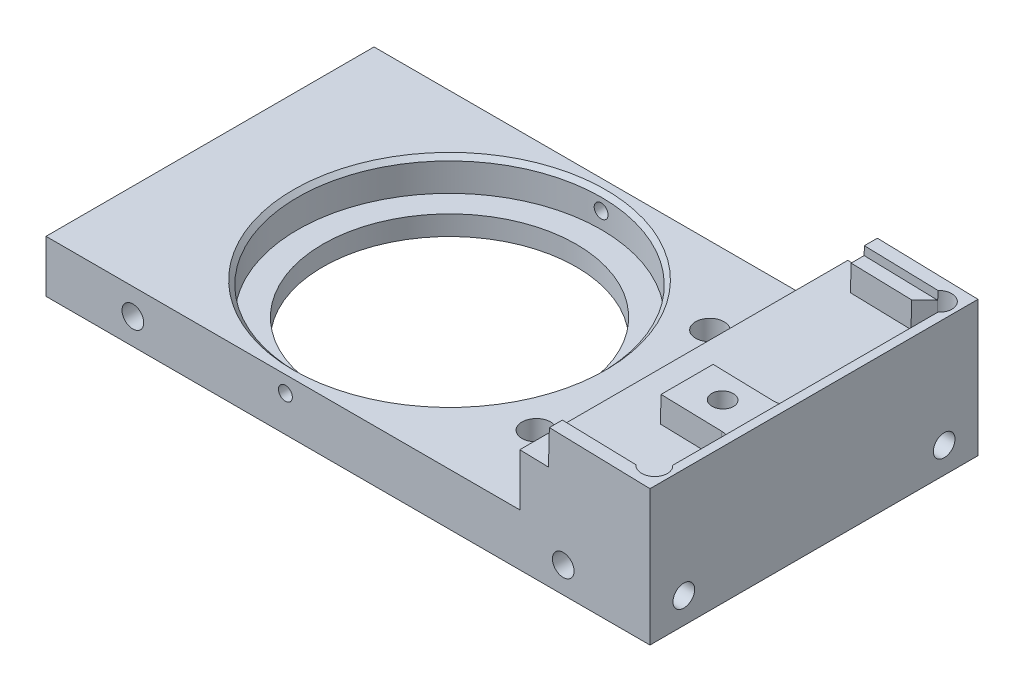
ISO-10303-21;
HEADER;
FILE_DESCRIPTION(('STEP AP214'),'2;1');
FILE_NAME('part.step','',(''),(''),'','','');
FILE_SCHEMA(('AUTOMOTIVE_DESIGN { 1 0 10303 214 1 1 1 1 }'));
ENDSEC;
DATA;
#1=APPLICATION_CONTEXT('core data for automotive mechanical design processes');
#2=APPLICATION_PROTOCOL_DEFINITION('international standard','automotive_design',2000,#1);
#3=PRODUCT_CONTEXT('',#1,'mechanical');
#4=PRODUCT('Part','Part','',(#3));
#5=PRODUCT_RELATED_PRODUCT_CATEGORY('part','',(#4));
#6=PRODUCT_DEFINITION_FORMATION('','',#4);
#7=PRODUCT_DEFINITION_CONTEXT('part definition',#1,'design');
#8=PRODUCT_DEFINITION('design','',#6,#7);
#9=PRODUCT_DEFINITION_SHAPE('','',#8);
#10=(LENGTH_UNIT() NAMED_UNIT(*) SI_UNIT(.MILLI.,.METRE.));
#11=(NAMED_UNIT(*) PLANE_ANGLE_UNIT() SI_UNIT($,.RADIAN.));
#12=(NAMED_UNIT(*) SI_UNIT($,.STERADIAN.) SOLID_ANGLE_UNIT());
#13=UNCERTAINTY_MEASURE_WITH_UNIT(LENGTH_MEASURE(1.E-05),#10,'distance_accuracy_value','');
#14=(GEOMETRIC_REPRESENTATION_CONTEXT(3) GLOBAL_UNCERTAINTY_ASSIGNED_CONTEXT((#13)) GLOBAL_UNIT_ASSIGNED_CONTEXT((#10,
#11,#12)) REPRESENTATION_CONTEXT('',''));
#15=CARTESIAN_POINT('',(0.,0.,0.));
#16=DIRECTION('',(0.,0.,1.));
#17=DIRECTION('',(1.,0.,0.));
#18=AXIS2_PLACEMENT_3D('',#15,#16,#17);
#19=CARTESIAN_POINT('',(-30.,5.9944,-18.9));
#20=DIRECTION('',(0.,0.,1.));
#21=DIRECTION('',(1.,0.,0.));
#22=AXIS2_PLACEMENT_3D('',#19,#20,#21);
#23=PLANE('',#22);
#24=CARTESIAN_POINT('',(32.0051,2.9972,-18.9));
#25=DIRECTION('',(0.,0.,-1.));
#26=DIRECTION('',(-1.,0.,0.));
#27=AXIS2_PLACEMENT_3D('',#24,#25,#26);
#28=CIRCLE('',#27,1.24999999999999);
#29=CARTESIAN_POINT('',(30.7551,2.9972,-18.9));
#30=VERTEX_POINT('',#29);
#31=EDGE_CURVE('E1295',#30,#30,#28,.T.);
#32=ORIENTED_EDGE('',*,*,#31,.F.);
#33=EDGE_LOOP('',(#32));
#34=FACE_BOUND('',#33,.T.);
#35=CARTESIAN_POINT('',(-17.5884,2.9972,-18.9));
#36=DIRECTION('',(0.,0.,-1.));
#37=DIRECTION('',(-1.,0.,0.));
#38=AXIS2_PLACEMENT_3D('',#35,#36,#37);
#39=CIRCLE('',#38,1.24999999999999);
#40=CARTESIAN_POINT('',(-18.8384,2.9972,-18.9));
#41=VERTEX_POINT('',#40);
#42=EDGE_CURVE('E369',#41,#41,#39,.T.);
#43=ORIENTED_EDGE('',*,*,#42,.F.);
#44=EDGE_LOOP('',(#43));
#45=FACE_BOUND('',#44,.T.);
#46=CARTESIAN_POINT('',(-0.0115999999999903,4.1275,-18.9));
#47=DIRECTION('',(0.,0.,-1.));
#48=DIRECTION('',(-1.,0.,0.));
#49=AXIS2_PLACEMENT_3D('',#46,#47,#48);
#50=CIRCLE('',#49,0.799999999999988);
#51=CARTESIAN_POINT('',(-0.811599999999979,4.1275,-18.9));
#52=VERTEX_POINT('',#51);
#53=EDGE_CURVE('E361',#52,#52,#50,.T.);
#54=ORIENTED_EDGE('',*,*,#53,.F.);
#55=EDGE_LOOP('',(#54));
#56=FACE_BOUND('',#55,.T.);
#57=DIRECTION('',(0.,-1.,0.));
#58=VECTOR('',#57,1.);
#59=CARTESIAN_POINT('',(-27.6,5.9944,-18.9));
#60=LINE('',#59,#58);
#61=CARTESIAN_POINT('',(-27.6,5.9944,-18.9));
#62=VERTEX_POINT('',#61);
#63=CARTESIAN_POINT('',(-27.6,0.,-18.9));
#64=VERTEX_POINT('',#63);
#65=EDGE_CURVE('E96',#62,#64,#60,.T.);
#66=ORIENTED_EDGE('',*,*,#65,.F.);
#67=DIRECTION('',(-1.,0.,0.));
#68=VECTOR('',#67,1.);
#69=CARTESIAN_POINT('',(-30.,5.9944,-18.9));
#70=LINE('',#69,#68);
#71=CARTESIAN_POINT('',(27.,5.9944,-18.9));
#72=VERTEX_POINT('',#71);
#73=EDGE_CURVE('E314',#72,#62,#70,.T.);
#74=ORIENTED_EDGE('',*,*,#73,.F.);
#75=DIRECTION('',(0.,-1.,0.));
#76=VECTOR('',#75,1.);
#77=CARTESIAN_POINT('',(27.,72.6674316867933,-18.9));
#78=LINE('',#77,#76);
#79=CARTESIAN_POINT('',(27.,11.9986288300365,-18.9));
#80=VERTEX_POINT('',#79);
#81=EDGE_CURVE('E324',#80,#72,#78,.T.);
#82=ORIENTED_EDGE('',*,*,#81,.F.);
#83=DIRECTION('',(-0.999657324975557,0.0261769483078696,0.));
#84=VECTOR('',#83,1.);
#85=CARTESIAN_POINT('',(-29.8038232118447,13.4860892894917,-18.9));
#86=LINE('',#85,#84);
#87=CARTESIAN_POINT('',(30.3008684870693,11.9121925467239,-18.9));
#88=VERTEX_POINT('',#87);
#89=EDGE_CURVE('E343',#88,#80,#86,.T.);
#90=ORIENTED_EDGE('',*,*,#89,.F.);
#91=DIRECTION('',(-0.0261769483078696,-0.999657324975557,0.));
#92=VECTOR('',#91,1.);
#93=CARTESIAN_POINT('',(30.104691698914,4.42050325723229,-18.9));
#94=LINE('',#93,#92);
#95=CARTESIAN_POINT('',(30.4055762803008,15.9108218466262,-18.9));
#96=VERTEX_POINT('',#95);
#97=EDGE_CURVE('E352',#96,#88,#94,.T.);
#98=ORIENTED_EDGE('',*,*,#97,.F.);
#99=DIRECTION('',(0.999657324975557,-0.0261769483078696,0.));
#100=VECTOR('',#99,1.);
#101=CARTESIAN_POINT('',(-29.6991154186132,17.4847185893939,-18.9));
#102=LINE('',#101,#100);
#103=CARTESIAN_POINT('',(42.,15.6072111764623,-18.9));
#104=VERTEX_POINT('',#103);
#105=EDGE_CURVE('E629',#96,#104,#102,.T.);
#106=ORIENTED_EDGE('',*,*,#105,.T.);
#107=DIRECTION('',(0.,-1.,0.));
#108=VECTOR('',#107,1.);
#109=CARTESIAN_POINT('',(42.,5.9944,-18.9));
#110=LINE('',#109,#108);
#111=CARTESIAN_POINT('',(42.,0.,-18.9));
#112=VERTEX_POINT('',#111);
#113=EDGE_CURVE('E311',#104,#112,#110,.T.);
#114=ORIENTED_EDGE('',*,*,#113,.T.);
#115=DIRECTION('',(-1.,0.,0.));
#116=VECTOR('',#115,1.);
#117=CARTESIAN_POINT('',(-30.,0.,-18.9));
#118=LINE('',#117,#116);
#119=EDGE_CURVE('E302',#112,#64,#118,.T.);
#120=ORIENTED_EDGE('',*,*,#119,.T.);
#121=EDGE_LOOP('',(#66,#74,#82,#90,#98,#106,#114,#120));
#122=FACE_BOUND('',#121,.T.);
#123=ADVANCED_FACE('F78',(#34,#45,#56,#122),#23,.F.);
#124=CARTESIAN_POINT('',(-30.,5.9944,18.9));
#125=DIRECTION('',(0.,0.,-1.));
#126=DIRECTION('',(-1.,0.,0.));
#127=AXIS2_PLACEMENT_3D('',#124,#125,#126);
#128=PLANE('',#127);
#129=CARTESIAN_POINT('',(-0.0115999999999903,4.1275,18.9));
#130=DIRECTION('',(0.,0.,1.));
#131=DIRECTION('',(1.,0.,0.));
#132=AXIS2_PLACEMENT_3D('',#129,#130,#131);
#133=CIRCLE('',#132,0.799999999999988);
#134=CARTESIAN_POINT('',(0.788399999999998,4.1275,18.9));
#135=VERTEX_POINT('',#134);
#136=EDGE_CURVE('E1256',#135,#135,#133,.T.);
#137=ORIENTED_EDGE('',*,*,#136,.F.);
#138=EDGE_LOOP('',(#137));
#139=FACE_BOUND('',#138,.T.);
#140=CARTESIAN_POINT('',(-17.5884,2.9972,18.9));
#141=DIRECTION('',(0.,0.,1.));
#142=DIRECTION('',(1.,0.,0.));
#143=AXIS2_PLACEMENT_3D('',#140,#141,#142);
#144=CIRCLE('',#143,1.24999999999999);
#145=CARTESIAN_POINT('',(-16.3384,2.9972,18.9));
#146=VERTEX_POINT('',#145);
#147=EDGE_CURVE('E1255',#146,#146,#144,.T.);
#148=ORIENTED_EDGE('',*,*,#147,.F.);
#149=EDGE_LOOP('',(#148));
#150=FACE_BOUND('',#149,.T.);
#151=CARTESIAN_POINT('',(32.0051,2.9972,18.9));
#152=DIRECTION('',(0.,0.,1.));
#153=DIRECTION('',(1.,0.,0.));
#154=AXIS2_PLACEMENT_3D('',#151,#152,#153);
#155=CIRCLE('',#154,1.24999999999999);
#156=CARTESIAN_POINT('',(33.2551,2.9972,18.9));
#157=VERTEX_POINT('',#156);
#158=EDGE_CURVE('E1273',#157,#157,#155,.T.);
#159=ORIENTED_EDGE('',*,*,#158,.F.);
#160=EDGE_LOOP('',(#159));
#161=FACE_BOUND('',#160,.T.);
#162=DIRECTION('',(0.,1.,0.));
#163=VECTOR('',#162,1.);
#164=CARTESIAN_POINT('',(-27.6,5.9944,18.9));
#165=LINE('',#164,#163);
#166=CARTESIAN_POINT('',(-27.6,0.,18.9));
#167=VERTEX_POINT('',#166);
#168=CARTESIAN_POINT('',(-27.6,5.9944,18.9));
#169=VERTEX_POINT('',#168);
#170=EDGE_CURVE('E277',#167,#169,#165,.T.);
#171=ORIENTED_EDGE('',*,*,#170,.F.);
#172=DIRECTION('',(1.,0.,0.));
#173=VECTOR('',#172,1.);
#174=CARTESIAN_POINT('',(-30.,0.,18.9));
#175=LINE('',#174,#173);
#176=CARTESIAN_POINT('',(42.,0.,18.9));
#177=VERTEX_POINT('',#176);
#178=EDGE_CURVE('E289',#167,#177,#175,.T.);
#179=ORIENTED_EDGE('',*,*,#178,.T.);
#180=DIRECTION('',(0.,-1.,0.));
#181=VECTOR('',#180,1.);
#182=CARTESIAN_POINT('',(42.,5.9944,18.9));
#183=LINE('',#182,#181);
#184=CARTESIAN_POINT('',(42.,15.6072111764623,18.9));
#185=VERTEX_POINT('',#184);
#186=EDGE_CURVE('E313',#185,#177,#183,.T.);
#187=ORIENTED_EDGE('',*,*,#186,.F.);
#188=DIRECTION('',(-0.999657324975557,0.0261769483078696,0.));
#189=VECTOR('',#188,1.);
#190=CARTESIAN_POINT('',(-29.6991154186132,17.4847185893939,18.9));
#191=LINE('',#190,#189);
#192=CARTESIAN_POINT('',(30.4055762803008,15.9108218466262,18.9));
#193=VERTEX_POINT('',#192);
#194=EDGE_CURVE('E630',#185,#193,#191,.T.);
#195=ORIENTED_EDGE('',*,*,#194,.T.);
#196=DIRECTION('',(0.0261769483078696,0.999657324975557,0.));
#197=VECTOR('',#196,1.);
#198=CARTESIAN_POINT('',(30.104691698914,4.42050325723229,18.9));
#199=LINE('',#198,#197);
#200=CARTESIAN_POINT('',(30.3008684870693,11.9121925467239,18.9));
#201=VERTEX_POINT('',#200);
#202=EDGE_CURVE('E358',#201,#193,#199,.T.);
#203=ORIENTED_EDGE('',*,*,#202,.F.);
#204=DIRECTION('',(0.999657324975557,-0.0261769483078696,0.));
#205=VECTOR('',#204,1.);
#206=CARTESIAN_POINT('',(-29.8038232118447,13.4860892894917,18.9));
#207=LINE('',#206,#205);
#208=CARTESIAN_POINT('',(27.,11.9986288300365,18.9));
#209=VERTEX_POINT('',#208);
#210=EDGE_CURVE('E340',#209,#201,#207,.T.);
#211=ORIENTED_EDGE('',*,*,#210,.F.);
#212=DIRECTION('',(0.,-1.,0.));
#213=VECTOR('',#212,1.);
#214=CARTESIAN_POINT('',(27.,72.6674316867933,18.9));
#215=LINE('',#214,#213);
#216=CARTESIAN_POINT('',(27.,5.9944,18.9));
#217=VERTEX_POINT('',#216);
#218=EDGE_CURVE('E299',#209,#217,#215,.T.);
#219=ORIENTED_EDGE('',*,*,#218,.T.);
#220=DIRECTION('',(1.,0.,0.));
#221=VECTOR('',#220,1.);
#222=CARTESIAN_POINT('',(-30.,5.9944,18.9));
#223=LINE('',#222,#221);
#224=EDGE_CURVE('E82',#169,#217,#223,.T.);
#225=ORIENTED_EDGE('',*,*,#224,.F.);
#226=EDGE_LOOP('',(#171,#179,#187,#195,#203,#211,#219,#225));
#227=FACE_BOUND('',#226,.T.);
#228=ADVANCED_FACE('F287',(#139,#150,#161,#227),#128,.F.);
#229=CARTESIAN_POINT('',(-30.,5.9944,18.9));
#230=DIRECTION('',(0.,1.,0.));
#231=DIRECTION('',(0.,0.,1.));
#232=AXIS2_PLACEMENT_3D('',#229,#230,#231);
#233=PLANE('',#232);
#234=CARTESIAN_POINT('',(20.,5.9944,-10.));
#235=DIRECTION('',(0.,1.,0.));
#236=DIRECTION('',(0.,0.,1.));
#237=AXIS2_PLACEMENT_3D('',#234,#235,#236);
#238=CIRCLE('',#237,1.65);
#239=CARTESIAN_POINT('',(20.,5.9944,-8.35));
#240=VERTEX_POINT('',#239);
#241=EDGE_CURVE('E617',#240,#240,#238,.T.);
#242=ORIENTED_EDGE('',*,*,#241,.F.);
#243=EDGE_LOOP('',(#242));
#244=FACE_BOUND('',#243,.T.);
#245=CARTESIAN_POINT('',(20.,5.9944,10.));
#246=DIRECTION('',(0.,1.,0.));
#247=DIRECTION('',(0.,0.,1.));
#248=AXIS2_PLACEMENT_3D('',#245,#246,#247);
#249=CIRCLE('',#248,1.65);
#250=CARTESIAN_POINT('',(20.,5.9944,11.65));
#251=VERTEX_POINT('',#250);
#252=EDGE_CURVE('E610',#251,#251,#249,.T.);
#253=ORIENTED_EDGE('',*,*,#252,.F.);
#254=EDGE_LOOP('',(#253));
#255=FACE_BOUND('',#254,.T.);
#256=CARTESIAN_POINT('',(0.00109999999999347,5.9944,0.));
#257=DIRECTION('',(0.,1.,0.));
#258=DIRECTION('',(0.,0.,1.));
#259=AXIS2_PLACEMENT_3D('',#256,#257,#258);
#260=CIRCLE('',#259,18.);
#261=CARTESIAN_POINT('',(0.00109999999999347,5.9944,18.));
#262=VERTEX_POINT('',#261);
#263=EDGE_CURVE('E88',#262,#262,#260,.F.);
#264=ORIENTED_EDGE('',*,*,#263,.T.);
#265=EDGE_LOOP('',(#264));
#266=FACE_BOUND('',#265,.T.);
#267=ORIENTED_EDGE('',*,*,#73,.T.);
#268=DIRECTION('',(0.,0.,1.));
#269=VECTOR('',#268,1.);
#270=CARTESIAN_POINT('',(-27.6,5.9944,18.9));
#271=LINE('',#270,#269);
#272=EDGE_CURVE('E292',#62,#169,#271,.T.);
#273=ORIENTED_EDGE('',*,*,#272,.T.);
#274=ORIENTED_EDGE('',*,*,#224,.T.);
#275=DIRECTION('',(0.,0.,1.));
#276=VECTOR('',#275,1.);
#277=CARTESIAN_POINT('',(27.,5.9944,-18.9));
#278=LINE('',#277,#276);
#279=EDGE_CURVE('E305',#72,#217,#278,.T.);
#280=ORIENTED_EDGE('',*,*,#279,.F.);
#281=EDGE_LOOP('',(#267,#273,#274,#280));
#282=FACE_BOUND('',#281,.T.);
#283=ADVANCED_FACE('F395',(#244,#255,#266,#282),#233,.T.);
#284=CARTESIAN_POINT('',(-30.,0.,18.9));
#285=DIRECTION('',(0.,1.,0.));
#286=DIRECTION('',(0.,0.,1.));
#287=AXIS2_PLACEMENT_3D('',#284,#285,#286);
#288=PLANE('',#287);
#289=CARTESIAN_POINT('',(0.00109999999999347,0.,0.));
#290=DIRECTION('',(0.,-1.,0.));
#291=DIRECTION('',(0.,0.,-1.));
#292=AXIS2_PLACEMENT_3D('',#289,#290,#291);
#293=CIRCLE('',#292,14.6);
#294=CARTESIAN_POINT('',(0.00109999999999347,0.,-14.6));
#295=VERTEX_POINT('',#294);
#296=EDGE_CURVE('E622',#295,#295,#293,.T.);
#297=ORIENTED_EDGE('',*,*,#296,.F.);
#298=EDGE_LOOP('',(#297));
#299=FACE_BOUND('',#298,.T.);
#300=CARTESIAN_POINT('',(20.,0.,-10.));
#301=DIRECTION('',(0.,-1.,0.));
#302=DIRECTION('',(0.,0.,-1.));
#303=AXIS2_PLACEMENT_3D('',#300,#301,#302);
#304=CIRCLE('',#303,1.65);
#305=CARTESIAN_POINT('',(20.,0.,-11.65));
#306=VERTEX_POINT('',#305);
#307=EDGE_CURVE('E614',#306,#306,#304,.T.);
#308=ORIENTED_EDGE('',*,*,#307,.F.);
#309=EDGE_LOOP('',(#308));
#310=FACE_BOUND('',#309,.T.);
#311=CARTESIAN_POINT('',(20.,0.,10.));
#312=DIRECTION('',(0.,-1.,0.));
#313=DIRECTION('',(0.,0.,-1.));
#314=AXIS2_PLACEMENT_3D('',#311,#312,#313);
#315=CIRCLE('',#314,1.65);
#316=CARTESIAN_POINT('',(20.,0.,8.35));
#317=VERTEX_POINT('',#316);
#318=EDGE_CURVE('E602',#317,#317,#315,.T.);
#319=ORIENTED_EDGE('',*,*,#318,.F.);
#320=EDGE_LOOP('',(#319));
#321=FACE_BOUND('',#320,.T.);
#322=DIRECTION('',(0.,0.,-1.));
#323=VECTOR('',#322,1.);
#324=CARTESIAN_POINT('',(-27.6,0.,-23.8074349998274));
#325=LINE('',#324,#323);
#326=EDGE_CURVE('E274',#167,#64,#325,.T.);
#327=ORIENTED_EDGE('',*,*,#326,.T.);
#328=ORIENTED_EDGE('',*,*,#119,.F.);
#329=DIRECTION('',(0.,0.,-1.));
#330=VECTOR('',#329,1.);
#331=CARTESIAN_POINT('',(42.,0.,-18.9));
#332=LINE('',#331,#330);
#333=EDGE_CURVE('E297',#177,#112,#332,.T.);
#334=ORIENTED_EDGE('',*,*,#333,.F.);
#335=ORIENTED_EDGE('',*,*,#178,.F.);
#336=EDGE_LOOP('',(#327,#328,#334,#335));
#337=FACE_BOUND('',#336,.T.);
#338=ADVANCED_FACE('F295',(#299,#310,#321,#337),#288,.F.);
#339=CARTESIAN_POINT('',(27.,72.6674316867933,-18.9));
#340=DIRECTION('',(1.,0.,0.));
#341=DIRECTION('',(0.,0.,-1.));
#342=AXIS2_PLACEMENT_3D('',#339,#340,#341);
#343=PLANE('',#342);
#344=DIRECTION('',(0.,0.,-1.));
#345=VECTOR('',#344,1.);
#346=CARTESIAN_POINT('',(27.,11.9986288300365,-18.9));
#347=LINE('',#346,#345);
#348=EDGE_CURVE('E661',#209,#80,#347,.T.);
#349=ORIENTED_EDGE('',*,*,#348,.T.);
#350=ORIENTED_EDGE('',*,*,#81,.T.);
#351=ORIENTED_EDGE('',*,*,#279,.T.);
#352=ORIENTED_EDGE('',*,*,#218,.F.);
#353=EDGE_LOOP('',(#349,#350,#351,#352));
#354=FACE_BOUND('',#353,.T.);
#355=ADVANCED_FACE('F660',(#354),#343,.F.);
#356=CARTESIAN_POINT('',(27.,16.,-18.90005));
#357=DIRECTION('',(-0.0261769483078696,-0.999657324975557,0.));
#358=DIRECTION('',(0.999657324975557,-0.0261769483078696,0.));
#359=AXIS2_PLACEMENT_3D('',#356,#357,#358);
#360=PLANE('',#359);
#361=DIRECTION('',(0.,0.,-1.));
#362=VECTOR('',#361,1.);
#363=CARTESIAN_POINT('',(30.4055762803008,15.9108218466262,-18.90005));
#364=LINE('',#363,#362);
#365=CARTESIAN_POINT('',(30.4055762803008,15.9108218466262,17.4000019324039));
#366=VERTEX_POINT('',#365);
#367=EDGE_CURVE('E353',#193,#366,#364,.T.);
#368=ORIENTED_EDGE('',*,*,#367,.F.);
#369=ORIENTED_EDGE('',*,*,#194,.F.);
#370=DIRECTION('',(0.,0.,1.));
#371=VECTOR('',#370,1.);
#372=CARTESIAN_POINT('',(42.,15.6072111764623,-18.90005));
#373=LINE('',#372,#371);
#374=EDGE_CURVE('E625',#104,#185,#373,.T.);
#375=ORIENTED_EDGE('',*,*,#374,.F.);
#376=ORIENTED_EDGE('',*,*,#105,.F.);
#377=CARTESIAN_POINT('',(30.4055762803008,15.9108218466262,-17.4000019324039));
#378=VERTEX_POINT('',#377);
#379=EDGE_CURVE('E350',#378,#96,#364,.T.);
#380=ORIENTED_EDGE('',*,*,#379,.F.);
#381=DIRECTION('',(-0.999657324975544,0.0261769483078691,-1.66609553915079E-07));
#382=VECTOR('',#381,1.);
#383=CARTESIAN_POINT('',(41.0003426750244,15.6333881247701,-17.4000001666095));
#384=LINE('',#383,#382);
#385=CARTESIAN_POINT('',(38.8830346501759,15.6888317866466,-17.4000005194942));
#386=VERTEX_POINT('',#385);
#387=EDGE_CURVE('E599',#386,#378,#384,.T.);
#388=ORIENTED_EDGE('',*,*,#387,.F.);
#389=CARTESIAN_POINT('',(40.0006853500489,15.659565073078,-16.4000003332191));
#390=DIRECTION('',(0.0261769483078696,0.999657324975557,0.));
#391=DIRECTION('',(-0.999657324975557,0.0261769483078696,0.));
#392=AXIS2_PLACEMENT_3D('',#389,#390,#391);
#393=CIRCLE('',#392,1.5);
#394=CARTESIAN_POINT('',(41.0003426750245,15.6333881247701,-15.2819663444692));
#395=VERTEX_POINT('',#394);
#396=EDGE_CURVE('E530',#395,#386,#393,.T.);
#397=ORIENTED_EDGE('',*,*,#396,.F.);
#398=DIRECTION('',(0.,0.,-1.));
#399=VECTOR('',#398,1.);
#400=CARTESIAN_POINT('',(41.0003426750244,15.6333881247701,-17.4000001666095));
#401=LINE('',#400,#399);
#402=CARTESIAN_POINT('',(41.0003426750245,15.6333881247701,15.2819663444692));
#403=VERTEX_POINT('',#402);
#404=EDGE_CURVE('E594',#403,#395,#401,.T.);
#405=ORIENTED_EDGE('',*,*,#404,.F.);
#406=CARTESIAN_POINT('',(40.0006853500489,15.659565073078,16.4000003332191));
#407=DIRECTION('',(0.0261769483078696,0.999657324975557,0.));
#408=DIRECTION('',(-0.999657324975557,0.0261769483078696,0.));
#409=AXIS2_PLACEMENT_3D('',#406,#407,#408);
#410=CIRCLE('',#409,1.5);
#411=CARTESIAN_POINT('',(38.8830346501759,15.6888317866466,17.4000005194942));
#412=VERTEX_POINT('',#411);
#413=EDGE_CURVE('E529',#412,#403,#410,.T.);
#414=ORIENTED_EDGE('',*,*,#413,.F.);
#415=DIRECTION('',(-0.999657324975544,0.0261769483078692,1.6660955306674E-07));
#416=VECTOR('',#415,1.);
#417=CARTESIAN_POINT('',(27.000006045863,15.9999998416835,17.400002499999));
#418=LINE('',#417,#416);
#419=EDGE_CURVE('E316',#412,#366,#418,.T.);
#420=ORIENTED_EDGE('',*,*,#419,.T.);
#421=EDGE_LOOP('',(#368,#369,#375,#376,#380,#388,#397,#405,#414,#420));
#422=FACE_BOUND('',#421,.T.);
#423=ADVANCED_FACE('F650',(#422),#360,.F.);
#424=CARTESIAN_POINT('',(40.9741657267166,14.6337307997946,17.4000001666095));
#425=DIRECTION('',(-0.0261769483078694,-0.999657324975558,0.));
#426=DIRECTION('',(0.999657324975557,-0.0261769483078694,0.));
#427=AXIS2_PLACEMENT_3D('',#424,#425,#426);
#428=PLANE('',#427);
#429=DIRECTION('',(0.,0.,-1.));
#430=VECTOR('',#429,1.);
#431=CARTESIAN_POINT('',(30.3793993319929,14.9111645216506,17.4000001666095));
#432=LINE('',#431,#430);
#433=CARTESIAN_POINT('',(30.3793993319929,14.9111645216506,-15.9000032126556));
#434=VERTEX_POINT('',#433);
#435=CARTESIAN_POINT('',(30.3793993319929,14.9111645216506,-17.4000024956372));
#436=VERTEX_POINT('',#435);
#437=EDGE_CURVE('E346',#434,#436,#432,.T.);
#438=ORIENTED_EDGE('',*,*,#437,.F.);
#439=DIRECTION('',(0.999657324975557,-0.0261769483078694,0.));
#440=VECTOR('',#439,1.);
#441=CARTESIAN_POINT('',(40.9741657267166,14.6337307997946,-15.9000032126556));
#442=LINE('',#441,#440);
#443=CARTESIAN_POINT('',(37.3573739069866,14.7284398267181,-15.9000032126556));
#444=VERTEX_POINT('',#443);
#445=EDGE_CURVE('E671',#434,#444,#442,.T.);
#446=ORIENTED_EDGE('',*,*,#445,.T.);
#447=DIRECTION('',(0.706864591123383,-0.0185099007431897,-0.707106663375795));
#448=VECTOR('',#447,1.);
#449=CARTESIAN_POINT('',(22.521474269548,15.1169315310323,-1.05902288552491));
#450=LINE('',#449,#448);
#451=CARTESIAN_POINT('',(38.856857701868,14.689174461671,-17.4000005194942));
#452=VERTEX_POINT('',#451);
#453=EDGE_CURVE('E591',#444,#452,#450,.T.);
#454=ORIENTED_EDGE('',*,*,#453,.T.);
#455=DIRECTION('',(-0.999657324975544,0.0261769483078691,-1.66609553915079E-07));
#456=VECTOR('',#455,1.);
#457=CARTESIAN_POINT('',(40.9741657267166,14.6337307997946,-17.4000001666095));
#458=LINE('',#457,#456);
#459=EDGE_CURVE('E598',#452,#436,#458,.T.);
#460=ORIENTED_EDGE('',*,*,#459,.T.);
#461=EDGE_LOOP('',(#438,#446,#454,#460));
#462=FACE_BOUND('',#461,.T.);
#463=ADVANCED_FACE('F731',(#462),#428,.F.);
#464=CARTESIAN_POINT('',(40.9741657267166,14.6337307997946,17.4000001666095));
#465=DIRECTION('',(1.6655246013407E-07,-4.3613296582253E-09,0.999999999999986));
#466=DIRECTION('',(0.999999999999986,0.,-1.6655246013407E-07));
#467=AXIS2_PLACEMENT_3D('',#464,#465,#466);
#468=PLANE('',#467);
#469=DIRECTION('',(-0.0261769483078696,-0.999657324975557,0.));
#470=VECTOR('',#469,1.);
#471=CARTESIAN_POINT('',(30.3793993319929,14.9111645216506,17.4000019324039));
#472=LINE('',#471,#470);
#473=CARTESIAN_POINT('',(30.3008684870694,11.9121925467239,17.4000019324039));
#474=VERTEX_POINT('',#473);
#475=EDGE_CURVE('E355',#366,#474,#472,.T.);
#476=ORIENTED_EDGE('',*,*,#475,.F.);
#477=ORIENTED_EDGE('',*,*,#419,.F.);
#478=DIRECTION('',(0.0261769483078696,0.999657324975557,0.));
#479=VECTOR('',#478,1.);
#480=CARTESIAN_POINT('',(37.6153371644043,-32.7225820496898,17.4000005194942));
#481=LINE('',#480,#479);
#482=CARTESIAN_POINT('',(38.7783268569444,11.6902024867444,17.4000005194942));
#483=VERTEX_POINT('',#482);
#484=EDGE_CURVE('E537',#483,#412,#481,.T.);
#485=ORIENTED_EDGE('',*,*,#484,.F.);
#486=DIRECTION('',(0.999657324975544,-0.0261769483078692,-1.66609553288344E-07));
#487=VECTOR('',#486,1.);
#488=CARTESIAN_POINT('',(38.7783268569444,11.6902024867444,17.4000005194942));
#489=LINE('',#488,#487);
#490=EDGE_CURVE('E532',#474,#483,#489,.T.);
#491=ORIENTED_EDGE('',*,*,#490,.F.);
#492=EDGE_LOOP('',(#476,#477,#485,#491));
#493=FACE_BOUND('',#492,.T.);
#494=ADVANCED_FACE('F734',(#493),#468,.F.);
#495=CARTESIAN_POINT('',(40.9741657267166,14.6337307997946,-17.4000001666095));
#496=DIRECTION('',(1.66552460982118E-07,-4.36132968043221E-09,-0.999999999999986));
#497=DIRECTION('',(-0.999999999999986,0.,-1.66552460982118E-07));
#498=AXIS2_PLACEMENT_3D('',#495,#496,#497);
#499=PLANE('',#498);
#500=DIRECTION('',(0.0261769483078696,0.999657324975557,0.));
#501=VECTOR('',#500,1.);
#502=CARTESIAN_POINT('',(30.3793993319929,14.9111645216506,-17.4000019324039));
#503=LINE('',#502,#501);
#504=EDGE_CURVE('E348',#436,#378,#503,.T.);
#505=ORIENTED_EDGE('',*,*,#504,.F.);
#506=ORIENTED_EDGE('',*,*,#459,.F.);
#507=DIRECTION('',(0.0261769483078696,0.999657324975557,0.));
#508=VECTOR('',#507,1.);
#509=CARTESIAN_POINT('',(37.6153371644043,-32.7225820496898,-17.4000005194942));
#510=LINE('',#509,#508);
#511=EDGE_CURVE('E550',#452,#386,#510,.T.);
#512=ORIENTED_EDGE('',*,*,#511,.T.);
#513=ORIENTED_EDGE('',*,*,#387,.T.);
#514=EDGE_LOOP('',(#505,#506,#512,#513));
#515=FACE_BOUND('',#514,.T.);
#516=ADVANCED_FACE('F737',(#515),#499,.F.);
#517=CARTESIAN_POINT('',(36.1158533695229,-32.6833166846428,-15.9000032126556));
#518=DIRECTION('',(0.,0.,-1.));
#519=DIRECTION('',(-1.,0.,0.));
#520=AXIS2_PLACEMENT_3D('',#517,#518,#519);
#521=PLANE('',#520);
#522=DIRECTION('',(0.0261769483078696,0.999657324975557,0.));
#523=VECTOR('',#522,1.);
#524=CARTESIAN_POINT('',(29.1378787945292,-32.5005919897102,-15.9000032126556));
#525=LINE('',#524,#523);
#526=CARTESIAN_POINT('',(30.3008684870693,11.9121925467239,-15.9000032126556));
#527=VERTEX_POINT('',#526);
#528=EDGE_CURVE('E13',#527,#434,#525,.T.);
#529=ORIENTED_EDGE('',*,*,#528,.F.);
#530=DIRECTION('',(-0.999657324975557,0.0261769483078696,0.));
#531=VECTOR('',#530,1.);
#532=CARTESIAN_POINT('',(37.278843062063,11.7294678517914,-15.9000032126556));
#533=LINE('',#532,#531);
#534=CARTESIAN_POINT('',(37.278843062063,11.7294678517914,-15.9000032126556));
#535=VERTEX_POINT('',#534);
#536=EDGE_CURVE('E538',#535,#527,#533,.T.);
#537=ORIENTED_EDGE('',*,*,#536,.F.);
#538=DIRECTION('',(0.0261769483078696,0.999657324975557,0.));
#539=VECTOR('',#538,1.);
#540=CARTESIAN_POINT('',(36.1158533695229,-32.6833166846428,-15.9000032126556));
#541=LINE('',#540,#539);
#542=EDGE_CURVE('E542',#535,#444,#541,.T.);
#543=ORIENTED_EDGE('',*,*,#542,.T.);
#544=ORIENTED_EDGE('',*,*,#445,.F.);
#545=EDGE_LOOP('',(#529,#537,#543,#544));
#546=FACE_BOUND('',#545,.T.);
#547=ADVANCED_FACE('F669',(#546),#521,.F.);
#548=CARTESIAN_POINT('',(36.4757077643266,14.75152706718,4.99999999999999));
#549=DIRECTION('',(0.0261769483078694,0.999657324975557,0.));
#550=DIRECTION('',(-0.999657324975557,0.0261769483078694,0.));
#551=AXIS2_PLACEMENT_3D('',#548,#549,#550);
#552=CIRCLE('',#551,1.24999999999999);
#553=CARTESIAN_POINT('',(35.2261361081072,14.7842482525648,4.99999999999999));
#554=VERTEX_POINT('',#553);
#555=EDGE_CURVE('E515',#554,#554,#552,.T.);
#556=ORIENTED_EDGE('',*,*,#555,.F.);
#557=EDGE_LOOP('',(#556));
#558=FACE_BOUND('',#557,.T.);
#559=DIRECTION('',(0.,0.,1.));
#560=VECTOR('',#559,1.);
#561=CARTESIAN_POINT('',(32.4770784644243,14.8562348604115,17.4000001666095));
#562=LINE('',#561,#560);
#563=CARTESIAN_POINT('',(32.4770784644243,14.8562348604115,2.1));
#564=VERTEX_POINT('',#563);
#565=CARTESIAN_POINT('',(32.4770784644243,14.8562348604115,8.1));
#566=VERTEX_POINT('',#565);
#567=EDGE_CURVE('E674',#564,#566,#562,.T.);
#568=ORIENTED_EDGE('',*,*,#567,.T.);
#569=DIRECTION('',(0.999657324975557,-0.0261769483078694,0.));
#570=VECTOR('',#569,1.);
#571=CARTESIAN_POINT('',(40.9741657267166,14.6337307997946,8.1));
#572=LINE('',#571,#570);
#573=CARTESIAN_POINT('',(39.4746797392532,14.6729962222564,8.1));
#574=VERTEX_POINT('',#573);
#575=EDGE_CURVE('E588',#566,#574,#572,.T.);
#576=ORIENTED_EDGE('',*,*,#575,.T.);
#577=CARTESIAN_POINT('',(39.4746797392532,14.6729962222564,9.6));
#578=DIRECTION('',(-0.0261769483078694,-0.999657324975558,0.));
#579=DIRECTION('',(0.999657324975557,-0.0261769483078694,0.));
#580=AXIS2_PLACEMENT_3D('',#577,#578,#579);
#581=CIRCLE('',#580,1.5);
#582=CARTESIAN_POINT('',(40.9741657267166,14.6337307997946,9.6));
#583=VERTEX_POINT('',#582);
#584=EDGE_CURVE('E448',#574,#583,#581,.T.);
#585=ORIENTED_EDGE('',*,*,#584,.T.);
#586=DIRECTION('',(0.,0.,-1.));
#587=VECTOR('',#586,1.);
#588=CARTESIAN_POINT('',(40.9741657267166,14.6337307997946,-17.4000001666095));
#589=LINE('',#588,#587);
#590=CARTESIAN_POINT('',(40.9741657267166,14.6337307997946,0.599999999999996));
#591=VERTEX_POINT('',#590);
#592=EDGE_CURVE('E595',#583,#591,#589,.T.);
#593=ORIENTED_EDGE('',*,*,#592,.T.);
#594=CARTESIAN_POINT('',(39.4746797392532,14.6729962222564,0.599999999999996));
#595=DIRECTION('',(-0.0261769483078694,-0.999657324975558,0.));
#596=DIRECTION('',(0.999657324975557,-0.0261769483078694,0.));
#597=AXIS2_PLACEMENT_3D('',#594,#595,#596);
#598=CIRCLE('',#597,1.5);
#599=CARTESIAN_POINT('',(39.4746797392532,14.6729962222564,2.1));
#600=VERTEX_POINT('',#599);
#601=EDGE_CURVE('E445',#591,#600,#598,.T.);
#602=ORIENTED_EDGE('',*,*,#601,.T.);
#603=DIRECTION('',(-0.999657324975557,0.0261769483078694,0.));
#604=VECTOR('',#603,1.);
#605=CARTESIAN_POINT('',(40.9741657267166,14.6337307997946,2.1));
#606=LINE('',#605,#604);
#607=EDGE_CURVE('E541',#600,#564,#606,.T.);
#608=ORIENTED_EDGE('',*,*,#607,.T.);
#609=EDGE_LOOP('',(#568,#576,#585,#593,#602,#608));
#610=FACE_BOUND('',#609,.T.);
#611=ADVANCED_FACE('F701',(#558,#610),#428,.F.);
#612=CARTESIAN_POINT('',(0.00109999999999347,16.0002625,0.));
#613=DIRECTION('',(0.,-1.,0.));
#614=DIRECTION('',(0.,0.,-1.));
#615=AXIS2_PLACEMENT_3D('',#612,#613,#614);
#616=CYLINDRICAL_SURFACE('',#615,14.6);
#617=ORIENTED_EDGE('',*,*,#296,.T.);
#618=EDGE_LOOP('',(#617));
#619=FACE_BOUND('',#618,.T.);
#620=CARTESIAN_POINT('',(0.00109999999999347,2.2606,0.));
#621=DIRECTION('',(0.,1.,0.));
#622=DIRECTION('',(0.,0.,1.));
#623=AXIS2_PLACEMENT_3D('',#620,#621,#622);
#624=CIRCLE('',#623,14.6);
#625=CARTESIAN_POINT('',(0.00109999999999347,2.2606,14.6));
#626=VERTEX_POINT('',#625);
#627=EDGE_CURVE('E621',#626,#626,#624,.F.);
#628=ORIENTED_EDGE('',*,*,#627,.F.);
#629=EDGE_LOOP('',(#628));
#630=FACE_BOUND('',#629,.T.);
#631=ADVANCED_FACE('F406',(#619,#630),#616,.F.);
#632=CARTESIAN_POINT('',(42.,5.9944,-18.9));
#633=DIRECTION('',(-1.,0.,0.));
#634=DIRECTION('',(0.,0.,1.));
#635=AXIS2_PLACEMENT_3D('',#632,#633,#634);
#636=PLANE('',#635);
#637=CARTESIAN_POINT('',(42.,2.9944,15.));
#638=DIRECTION('',(1.,0.,0.));
#639=DIRECTION('',(0.,0.,-1.));
#640=AXIS2_PLACEMENT_3D('',#637,#638,#639);
#641=CIRCLE('',#640,1.25);
#642=CARTESIAN_POINT('',(42.,2.9944,13.75));
#643=VERTEX_POINT('',#642);
#644=EDGE_CURVE('E467',#643,#643,#641,.T.);
#645=ORIENTED_EDGE('',*,*,#644,.F.);
#646=EDGE_LOOP('',(#645));
#647=FACE_BOUND('',#646,.T.);
#648=CARTESIAN_POINT('',(42.,2.9944,-15.));
#649=DIRECTION('',(1.,0.,0.));
#650=DIRECTION('',(0.,0.,-1.));
#651=AXIS2_PLACEMENT_3D('',#648,#649,#650);
#652=CIRCLE('',#651,1.25);
#653=CARTESIAN_POINT('',(42.,2.9944,-16.25));
#654=VERTEX_POINT('',#653);
#655=EDGE_CURVE('E505',#654,#654,#652,.T.);
#656=ORIENTED_EDGE('',*,*,#655,.F.);
#657=EDGE_LOOP('',(#656));
#658=FACE_BOUND('',#657,.T.);
#659=ORIENTED_EDGE('',*,*,#113,.F.);
#660=ORIENTED_EDGE('',*,*,#374,.T.);
#661=ORIENTED_EDGE('',*,*,#186,.T.);
#662=ORIENTED_EDGE('',*,*,#333,.T.);
#663=EDGE_LOOP('',(#659,#660,#661,#662));
#664=FACE_BOUND('',#663,.T.);
#665=ADVANCED_FACE('F403',(#647,#658,#664),#636,.F.);
#666=CARTESIAN_POINT('',(0.00109999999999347,2.2606,0.));
#667=DIRECTION('',(0.,1.,0.));
#668=DIRECTION('',(0.,0.,1.));
#669=AXIS2_PLACEMENT_3D('',#666,#667,#668);
#670=PLANE('',#669);
#671=CARTESIAN_POINT('',(0.00109999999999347,2.2606,0.));
#672=DIRECTION('',(0.,1.,0.));
#673=DIRECTION('',(0.,0.,1.));
#674=AXIS2_PLACEMENT_3D('',#671,#672,#673);
#675=CIRCLE('',#674,17.5);
#676=CARTESIAN_POINT('',(0.00109999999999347,2.2606,17.5));
#677=VERTEX_POINT('',#676);
#678=EDGE_CURVE('E618',#677,#677,#675,.T.);
#679=ORIENTED_EDGE('',*,*,#678,.T.);
#680=EDGE_LOOP('',(#679));
#681=FACE_BOUND('',#680,.T.);
#682=ORIENTED_EDGE('',*,*,#627,.T.);
#683=EDGE_LOOP('',(#682));
#684=FACE_BOUND('',#683,.T.);
#685=ADVANCED_FACE('F405',(#681,#684),#670,.T.);
#686=CARTESIAN_POINT('',(0.00109999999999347,2.2606,0.));
#687=DIRECTION('',(0.,1.,0.));
#688=DIRECTION('',(0.,0.,1.));
#689=AXIS2_PLACEMENT_3D('',#686,#687,#688);
#690=CYLINDRICAL_SURFACE('',#689,17.5);
#691=CARTESIAN_POINT('',(-0.811599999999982,4.1275,-17.4811189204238));
#692=CARTESIAN_POINT('',(-0.811598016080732,4.08258980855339,-17.4811191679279));
#693=CARTESIAN_POINT('',(-0.807805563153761,4.03764764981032,-17.4812966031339));
#694=CARTESIAN_POINT('',(-0.792730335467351,3.94900281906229,-17.4819875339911));
#695=CARTESIAN_POINT('',(-0.781438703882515,3.90530167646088,-17.4825014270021));
#696=CARTESIAN_POINT('',(-0.751688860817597,3.8204358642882,-17.4838076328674));
#697=CARTESIAN_POINT('',(-0.733234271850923,3.77926992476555,-17.4845998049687));
#698=CARTESIAN_POINT('',(-0.689687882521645,3.70063144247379,-17.4863742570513));
#699=CARTESIAN_POINT('',(-0.664597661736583,3.66315802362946,-17.4873564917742));
#700=CARTESIAN_POINT('',(-0.608467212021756,3.59292366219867,-17.4894029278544));
#701=CARTESIAN_POINT('',(-0.577422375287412,3.56016640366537,-17.490467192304));
#702=CARTESIAN_POINT('',(-0.510273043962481,3.50032553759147,-17.4925590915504));
#703=CARTESIAN_POINT('',(-0.474168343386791,3.47324216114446,-17.4935867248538));
#704=CARTESIAN_POINT('',(-0.397904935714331,3.42550780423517,-17.4954922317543));
#705=CARTESIAN_POINT('',(-0.357744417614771,3.40485971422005,-17.496370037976));
#706=CARTESIAN_POINT('',(-0.274522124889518,3.37060051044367,-17.4978788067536));
#707=CARTESIAN_POINT('',(-0.231460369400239,3.35698935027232,-17.4985097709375));
#708=CARTESIAN_POINT('',(-0.143689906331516,3.33719964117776,-17.4994559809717));
#709=CARTESIAN_POINT('',(-0.0989823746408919,3.33101588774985,-17.4997714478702));
#710=CARTESIAN_POINT('',(-0.00916276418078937,3.32624060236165,-17.5000546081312));
#711=CARTESIAN_POINT('',(0.0359493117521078,3.32764901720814,-17.5000223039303));
#712=CARTESIAN_POINT('',(0.12526082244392,3.33801372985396,-17.499616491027));
#713=CARTESIAN_POINT('',(0.169460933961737,3.34696420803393,-17.4992432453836));
#714=CARTESIAN_POINT('',(0.255730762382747,3.37215009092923,-17.4982006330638));
#715=CARTESIAN_POINT('',(0.297800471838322,3.38838552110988,-17.4975312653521));
#716=CARTESIAN_POINT('',(0.378632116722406,3.4276863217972,-17.4959739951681));
#717=CARTESIAN_POINT('',(0.417392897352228,3.45075406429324,-17.4950860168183));
#718=CARTESIAN_POINT('',(0.490494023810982,3.50306295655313,-17.4931938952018));
#719=CARTESIAN_POINT('',(0.524834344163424,3.53230414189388,-17.4921897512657));
#720=CARTESIAN_POINT('',(0.588152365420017,3.59616145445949,-17.4901794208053));
#721=CARTESIAN_POINT('',(0.617125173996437,3.63078243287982,-17.4891732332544));
#722=CARTESIAN_POINT('',(0.668848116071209,3.70439948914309,-17.4872749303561));
#723=CARTESIAN_POINT('',(0.69159824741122,3.74339556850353,-17.4863828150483));
#724=CARTESIAN_POINT('',(0.73023008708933,3.82465966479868,-17.4848146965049));
#725=CARTESIAN_POINT('',(0.746111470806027,3.86692783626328,-17.4841387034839));
#726=CARTESIAN_POINT('',(0.770551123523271,3.9535342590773,-17.4830802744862));
#727=CARTESIAN_POINT('',(0.779109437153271,3.99787249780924,-17.4826978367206));
#728=CARTESIAN_POINT('',(0.788654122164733,4.0873189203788,-17.4822704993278));
#729=CARTESIAN_POINT('',(0.789647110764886,4.13242639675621,-17.4822253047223));
#730=CARTESIAN_POINT('',(0.784050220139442,4.22216735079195,-17.4824768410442));
#731=CARTESIAN_POINT('',(0.777460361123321,4.26680082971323,-17.4827735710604));
#732=CARTESIAN_POINT('',(0.756890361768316,4.3543080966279,-17.4836748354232));
#733=CARTESIAN_POINT('',(0.742913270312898,4.39718260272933,-17.4842792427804));
#734=CARTESIAN_POINT('',(0.707968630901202,4.47997698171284,-17.4857267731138));
#735=CARTESIAN_POINT('',(0.687001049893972,4.5198968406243,-17.4865698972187));
#736=CARTESIAN_POINT('',(0.638653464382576,4.59567941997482,-17.4883992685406));
#737=CARTESIAN_POINT('',(0.611268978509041,4.63153927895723,-17.4893856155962));
#738=CARTESIAN_POINT('',(0.550871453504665,4.69815512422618,-17.4913882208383));
#739=CARTESIAN_POINT('',(0.517858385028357,4.72891108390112,-17.4924044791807));
#740=CARTESIAN_POINT('',(0.447112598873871,4.78446807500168,-17.4943511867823));
#741=CARTESIAN_POINT('',(0.409376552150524,4.80926486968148,-17.495281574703));
#742=CARTESIAN_POINT('',(0.330272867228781,4.85217061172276,-17.4969485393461));
#743=CARTESIAN_POINT('',(0.288905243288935,4.87027958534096,-17.4976851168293));
#744=CARTESIAN_POINT('',(0.203729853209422,4.89928773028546,-17.4988786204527));
#745=CARTESIAN_POINT('',(0.159923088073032,4.91018983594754,-17.4993356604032));
#746=CARTESIAN_POINT('',(0.0710988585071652,4.92448456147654,-17.4999163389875));
#747=CARTESIAN_POINT('',(0.0260813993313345,4.92787721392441,-17.500039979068));
#748=CARTESIAN_POINT('',(-0.0638432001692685,4.92705652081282,-17.4999372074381));
#749=CARTESIAN_POINT('',(-0.108750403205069,4.92284998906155,-17.4997111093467));
#750=CARTESIAN_POINT('',(-0.19722018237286,4.90696453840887,-17.4989321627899));
#751=CARTESIAN_POINT('',(-0.24078275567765,4.89528560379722,-17.4983793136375));
#752=CARTESIAN_POINT('',(-0.325329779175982,4.86478780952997,-17.4970063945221));
#753=CARTESIAN_POINT('',(-0.366314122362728,4.84596865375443,-17.4961863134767));
#754=CARTESIAN_POINT('',(-0.444541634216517,4.80172600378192,-17.4943687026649));
#755=CARTESIAN_POINT('',(-0.481784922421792,4.77630272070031,-17.4933711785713));
#756=CARTESIAN_POINT('',(-0.551508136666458,4.71954860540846,-17.4913076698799));
#757=CARTESIAN_POINT('',(-0.5839841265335,4.68821293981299,-17.4902416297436));
#758=CARTESIAN_POINT('',(-0.643224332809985,4.62052499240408,-17.4881596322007));
#759=CARTESIAN_POINT('',(-0.669987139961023,4.58417147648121,-17.4871436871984));
#760=CARTESIAN_POINT('',(-0.717051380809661,4.50745537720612,-17.4852742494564));
#761=CARTESIAN_POINT('',(-0.737347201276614,4.4670893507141,-17.4844208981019));
#762=CARTESIAN_POINT('',(-0.770849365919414,4.38354913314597,-17.4829739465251));
#763=CARTESIAN_POINT('',(-0.784064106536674,4.3403783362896,-17.4823800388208));
#764=CARTESIAN_POINT('',(-0.799553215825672,4.26869840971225,-17.4816757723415));
#765=CARTESIAN_POINT('',(-0.804065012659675,4.24065388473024,-17.481467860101));
#766=CARTESIAN_POINT('',(-0.810089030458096,4.18424382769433,-17.4811893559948));
#767=CARTESIAN_POINT('',(-0.811601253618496,4.15587829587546,-17.4811187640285));
#768=CARTESIAN_POINT('',(-0.811599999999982,4.1275,-17.4811189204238));
#769=B_SPLINE_CURVE_WITH_KNOTS('',3,(#691,#692,#693,#694,#695,#696,#697,#698,#699,#700,#701,
#702,#703,#704,#705,#706,#707,#708,#709,#710,#711,#712,#713,#714,#715,#716,#717,#718,#719,#720,
#721,#722,#723,#724,#725,#726,#727,#728,#729,#730,#731,#732,#733,#734,#735,#736,#737,#738,#739,
#740,#741,#742,#743,#744,#745,#746,#747,#748,#749,#750,#751,#752,#753,#754,#755,#756,#757,#758,
#759,#760,#761,#762,#763,#764,#765,#766,#767,#768),.UNSPECIFIED.,.T.,.F.,(4,2,2,2,2,2,2,2,2,2,2,
2,2,2,2,2,2,2,2,2,2,2,2,2,2,2,2,2,2,2,2,2,2,2,2,2,2,2,4),(0.,0.134626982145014,
0.269413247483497,0.404131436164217,0.538817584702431,0.673608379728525,0.808404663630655,
0.943261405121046,1.07811725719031,1.21287855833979,1.34763891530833,1.48229538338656,
1.61695232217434,1.75165606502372,1.88636058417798,2.02118728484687,2.15601403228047,
2.2908471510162,2.425679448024,2.56039379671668,2.69510778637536,2.82976621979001,
2.9644252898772,3.0991786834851,3.23393277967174,3.36878239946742,3.50363148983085,
3.63842564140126,3.77321920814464,3.90789197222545,4.04256501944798,4.17724365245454,
4.31191798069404,4.44670288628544,4.58152100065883,4.71645581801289,4.85123027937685,
4.93629977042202,5.02136919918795),.UNSPECIFIED.);
#770=CARTESIAN_POINT('',(-0.811599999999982,4.1275,-17.4811189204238));
#771=VERTEX_POINT('',#770);
#772=EDGE_CURVE('E362',#771,#771,#769,.T.);
#773=ORIENTED_EDGE('',*,*,#772,.F.);
#774=EDGE_LOOP('',(#773));
#775=FACE_BOUND('',#774,.T.);
#776=CARTESIAN_POINT('',(0.00109999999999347,3.327600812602,17.5));
#777=CARTESIAN_POINT('',(0.0460061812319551,3.32831577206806,17.4999997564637));
#778=CARTESIAN_POINT('',(0.0908841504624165,3.33282151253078,17.4998253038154));
#779=CARTESIAN_POINT('',(0.179281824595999,3.34930328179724,17.4991488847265));
#780=CARTESIAN_POINT('',(0.222799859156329,3.36128814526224,17.4986465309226));
#781=CARTESIAN_POINT('',(0.307185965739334,3.39238396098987,17.4973738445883));
#782=CARTESIAN_POINT('',(0.348055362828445,3.41149131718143,17.4966036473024));
#783=CARTESIAN_POINT('',(0.425995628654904,3.45628452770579,17.4948845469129));
#784=CARTESIAN_POINT('',(0.463067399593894,3.48196881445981,17.4939356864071));
#785=CARTESIAN_POINT('',(0.532403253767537,3.53921187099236,17.4919673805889));
#786=CARTESIAN_POINT('',(0.564663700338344,3.57077504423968,17.4909478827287));
#787=CARTESIAN_POINT('',(0.623430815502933,3.63887066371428,17.4889556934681));
#788=CARTESIAN_POINT('',(0.649937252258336,3.67540331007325,17.4879830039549));
#789=CARTESIAN_POINT('',(0.696451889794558,3.75241739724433,17.4861954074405));
#790=CARTESIAN_POINT('',(0.716457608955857,3.7929003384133,17.485380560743));
#791=CARTESIAN_POINT('',(0.749387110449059,3.87665468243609,17.4840023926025));
#792=CARTESIAN_POINT('',(0.762310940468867,3.91992606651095,17.483439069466));
#793=CARTESIAN_POINT('',(0.780701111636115,4.00799625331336,17.4826287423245));
#794=CARTESIAN_POINT('',(0.786172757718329,4.05279394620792,17.4823815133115));
#795=CARTESIAN_POINT('',(0.789519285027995,4.14267257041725,17.4822309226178));
#796=CARTESIAN_POINT('',(0.787394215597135,4.18775349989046,17.4823275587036));
#797=CARTESIAN_POINT('',(0.775612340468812,4.27688610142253,17.4828534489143));
#798=CARTESIAN_POINT('',(0.765960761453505,4.32093846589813,17.4832824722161));
#799=CARTESIAN_POINT('',(0.739407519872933,4.40679719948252,17.4844238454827));
#800=CARTESIAN_POINT('',(0.722505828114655,4.44860355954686,17.4851361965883));
#801=CARTESIAN_POINT('',(0.681924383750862,4.52880351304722,17.4867632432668));
#802=CARTESIAN_POINT('',(0.658241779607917,4.56719566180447,17.4876780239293));
#803=CARTESIAN_POINT('',(0.604773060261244,4.63946151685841,17.4896052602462));
#804=CARTESIAN_POINT('',(0.57498691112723,4.6733351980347,17.4906177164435));
#805=CARTESIAN_POINT('',(0.510125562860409,4.73563337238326,17.4926254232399));
#806=CARTESIAN_POINT('',(0.47504577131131,4.76405308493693,17.4936206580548));
#807=CARTESIAN_POINT('',(0.400609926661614,4.81460035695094,17.4954787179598));
#808=CARTESIAN_POINT('',(0.361253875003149,4.83672791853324,17.4963415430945));
#809=CARTESIAN_POINT('',(0.27938342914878,4.87406053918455,17.4978350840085));
#810=CARTESIAN_POINT('',(0.236869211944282,4.88926598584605,17.4984658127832));
#811=CARTESIAN_POINT('',(0.149887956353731,4.91232223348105,17.4994214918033));
#812=CARTESIAN_POINT('',(0.105420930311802,4.92017308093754,17.4997464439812));
#813=CARTESIAN_POINT('',(0.0158396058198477,4.92829205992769,17.500051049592));
#814=CARTESIAN_POINT('',(-0.0292740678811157,4.92856707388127,17.5000310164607));
#815=CARTESIAN_POINT('',(-0.118906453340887,4.92154416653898,17.4996459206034));
#816=CARTESIAN_POINT('',(-0.163425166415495,4.91424626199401,17.4992808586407));
#817=CARTESIAN_POINT('',(-0.250588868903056,4.89228987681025,17.4982442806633));
#818=CARTESIAN_POINT('',(-0.29323448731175,4.87763388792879,17.4975728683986));
#819=CARTESIAN_POINT('',(-0.375460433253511,4.84137987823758,17.4959965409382));
#820=CARTESIAN_POINT('',(-0.415040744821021,4.81978182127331,17.4950916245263));
#821=CARTESIAN_POINT('',(-0.490046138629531,4.77023710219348,17.493146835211));
#822=CARTESIAN_POINT('',(-0.525467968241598,4.74228552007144,17.4921068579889));
#823=CARTESIAN_POINT('',(-0.591118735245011,4.68083498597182,17.4900073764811));
#824=CARTESIAN_POINT('',(-0.6213476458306,4.6473360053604,17.4889478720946));
#825=CARTESIAN_POINT('',(-0.675775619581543,4.57571332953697,17.4869260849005));
#826=CARTESIAN_POINT('',(-0.699970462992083,4.53758642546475,17.4859638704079));
#827=CARTESIAN_POINT('',(-0.74161497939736,4.45780721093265,17.4842446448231));
#828=CARTESIAN_POINT('',(-0.759064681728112,4.41615491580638,17.4834876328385));
#829=CARTESIAN_POINT('',(-0.78671481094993,4.33052759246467,17.4822636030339));
#830=CARTESIAN_POINT('',(-0.796918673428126,4.28655367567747,17.4817964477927));
#831=CARTESIAN_POINT('',(-0.809798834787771,4.19751465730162,17.4812037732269));
#832=CARTESIAN_POINT('',(-0.812475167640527,4.15244956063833,17.4810782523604));
#833=CARTESIAN_POINT('',(-0.81022479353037,4.06255199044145,17.4811828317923));
#834=CARTESIAN_POINT('',(-0.80530512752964,4.01771934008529,17.4814126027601));
#835=CARTESIAN_POINT('',(-0.78801640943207,3.92951718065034,17.482201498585));
#836=CARTESIAN_POINT('',(-0.77564734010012,3.88614767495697,17.482760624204));
#837=CARTESIAN_POINT('',(-0.743811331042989,3.80209841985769,17.4841459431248));
#838=CARTESIAN_POINT('',(-0.724343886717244,3.76141886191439,17.4849721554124));
#839=CARTESIAN_POINT('',(-0.678865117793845,3.68390518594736,17.4867996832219));
#840=CARTESIAN_POINT('',(-0.652854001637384,3.64707094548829,17.487800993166));
#841=CARTESIAN_POINT('',(-0.595000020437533,3.57825797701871,17.4898685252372));
#842=CARTESIAN_POINT('',(-0.563152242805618,3.54628338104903,17.4909348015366));
#843=CARTESIAN_POINT('',(-0.494531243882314,3.48812499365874,17.4930136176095));
#844=CARTESIAN_POINT('',(-0.457756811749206,3.46194263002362,17.4940261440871));
#845=CARTESIAN_POINT('',(-0.380302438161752,3.41610261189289,17.4958861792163));
#846=CARTESIAN_POINT('',(-0.33961919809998,3.39645053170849,17.4967335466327));
#847=CARTESIAN_POINT('',(-0.255557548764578,3.36427954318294,17.4981680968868));
#848=CARTESIAN_POINT('',(-0.212182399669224,3.35175218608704,17.4987555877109));
#849=CARTESIAN_POINT('',(-0.140266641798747,3.33740374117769,17.4994512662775));
#850=CARTESIAN_POINT('',(-0.112155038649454,3.33333803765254,17.4996563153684));
#851=CARTESIAN_POINT('',(-0.0556585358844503,3.32821070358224,17.4999307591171));
#852=CARTESIAN_POINT('',(-0.0272736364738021,3.32714907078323,17.5000001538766));
#853=CARTESIAN_POINT('',(0.00109999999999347,3.327600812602,17.5));
#854=B_SPLINE_CURVE_WITH_KNOTS('',3,(#776,#777,#778,#779,#780,#781,#782,#783,#784,#785,#786,
#787,#788,#789,#790,#791,#792,#793,#794,#795,#796,#797,#798,#799,#800,#801,#802,#803,#804,#805,
#806,#807,#808,#809,#810,#811,#812,#813,#814,#815,#816,#817,#818,#819,#820,#821,#822,#823,#824,
#825,#826,#827,#828,#829,#830,#831,#832,#833,#834,#835,#836,#837,#838,#839,#840,#841,#842,#843,
#844,#845,#846,#847,#848,#849,#850,#851,#852,#853),.UNSPECIFIED.,.T.,.F.,(4,2,2,2,2,2,2,2,2,2,2,
2,2,2,2,2,2,2,2,2,2,2,2,2,2,2,2,2,2,2,2,2,2,2,2,2,2,2,4),(0.,0.134632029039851,
0.269423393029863,0.404146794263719,0.538838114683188,0.673630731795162,0.808428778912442,
0.943278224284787,1.07812676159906,1.21287925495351,1.347630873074,1.48228899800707,
1.61694766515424,1.75166304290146,1.88637916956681,2.02121284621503,2.15604647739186,
2.2908725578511,2.42569778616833,2.56040052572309,2.69510296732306,2.82975982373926,
2.96441738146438,3.09917957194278,3.23394245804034,3.3687993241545,3.50365560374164,
3.63844789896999,3.77323958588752,3.90790640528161,4.04257353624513,4.17725024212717,
4.31192265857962,4.44670895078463,4.58152843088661,4.71646270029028,4.85123662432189,
4.93630293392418,5.02136917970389),.UNSPECIFIED.);
#855=CARTESIAN_POINT('',(0.00109999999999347,3.327600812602,17.5));
#856=VERTEX_POINT('',#855);
#857=EDGE_CURVE('E1253',#856,#856,#854,.T.);
#858=ORIENTED_EDGE('',*,*,#857,.T.);
#859=EDGE_LOOP('',(#858));
#860=FACE_BOUND('',#859,.T.);
#861=CARTESIAN_POINT('',(0.00109999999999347,5.49440000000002,0.));
#862=DIRECTION('',(0.,1.,0.));
#863=DIRECTION('',(0.,0.,1.));
#864=AXIS2_PLACEMENT_3D('',#861,#862,#863);
#865=CIRCLE('',#864,17.5);
#866=CARTESIAN_POINT('',(0.00109999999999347,5.49440000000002,17.5));
#867=VERTEX_POINT('',#866);
#868=EDGE_CURVE('E452',#867,#867,#865,.T.);
#869=ORIENTED_EDGE('',*,*,#868,.T.);
#870=EDGE_LOOP('',(#869));
#871=FACE_BOUND('',#870,.T.);
#872=ORIENTED_EDGE('',*,*,#678,.F.);
#873=EDGE_LOOP('',(#872));
#874=FACE_BOUND('',#873,.T.);
#875=ADVANCED_FACE('F751',(#775,#860,#871,#874),#690,.F.);
#876=CARTESIAN_POINT('',(20.,0.,-10.));
#877=DIRECTION('',(0.,-1.,0.));
#878=DIRECTION('',(0.,0.,-1.));
#879=AXIS2_PLACEMENT_3D('',#876,#877,#878);
#880=CYLINDRICAL_SURFACE('',#879,1.65);
#881=ORIENTED_EDGE('',*,*,#241,.T.);
#882=EDGE_LOOP('',(#881));
#883=FACE_BOUND('',#882,.T.);
#884=ORIENTED_EDGE('',*,*,#307,.T.);
#885=EDGE_LOOP('',(#884));
#886=FACE_BOUND('',#885,.T.);
#887=ADVANCED_FACE('F747',(#883,#886),#880,.F.);
#888=CARTESIAN_POINT('',(20.,0.,10.));
#889=DIRECTION('',(0.,-1.,0.));
#890=DIRECTION('',(0.,0.,-1.));
#891=AXIS2_PLACEMENT_3D('',#888,#889,#890);
#892=CYLINDRICAL_SURFACE('',#891,1.65);
#893=ORIENTED_EDGE('',*,*,#252,.T.);
#894=EDGE_LOOP('',(#893));
#895=FACE_BOUND('',#894,.T.);
#896=ORIENTED_EDGE('',*,*,#318,.T.);
#897=EDGE_LOOP('',(#896));
#898=FACE_BOUND('',#897,.T.);
#899=ADVANCED_FACE('F744',(#895,#898),#892,.F.);
#900=CARTESIAN_POINT('',(40.9741657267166,14.6337307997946,-17.4000001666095));
#901=DIRECTION('',(0.999657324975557,-0.0261769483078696,0.));
#902=DIRECTION('',(0.0261769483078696,0.999657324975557,0.));
#903=AXIS2_PLACEMENT_3D('',#900,#901,#902);
#904=PLANE('',#903);
#905=DIRECTION('',(0.,0.,-1.));
#906=VECTOR('',#905,1.);
#907=CARTESIAN_POINT('',(40.895634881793,11.6347588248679,2.1));
#908=LINE('',#907,#906);
#909=CARTESIAN_POINT('',(40.895634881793,11.6347588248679,0.599999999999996));
#910=VERTEX_POINT('',#909);
#911=CARTESIAN_POINT('',(40.895634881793,11.6347588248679,-15.2819663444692));
#912=VERTEX_POINT('',#911);
#913=EDGE_CURVE('E551',#910,#912,#908,.T.);
#914=ORIENTED_EDGE('',*,*,#913,.F.);
#915=DIRECTION('',(0.0261769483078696,0.999657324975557,0.));
#916=VECTOR('',#915,1.);
#917=CARTESIAN_POINT('',(40.9741657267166,14.6337307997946,0.599999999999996));
#918=LINE('',#917,#916);
#919=EDGE_CURVE('E439',#910,#591,#918,.T.);
#920=ORIENTED_EDGE('',*,*,#919,.T.);
#921=ORIENTED_EDGE('',*,*,#592,.F.);
#922=DIRECTION('',(0.0261769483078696,0.999657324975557,0.));
#923=VECTOR('',#922,1.);
#924=CARTESIAN_POINT('',(40.895634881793,11.6347588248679,9.6));
#925=LINE('',#924,#923);
#926=CARTESIAN_POINT('',(40.895634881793,11.6347588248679,9.6));
#927=VERTEX_POINT('',#926);
#928=EDGE_CURVE('E425',#583,#927,#925,.F.);
#929=ORIENTED_EDGE('',*,*,#928,.T.);
#930=DIRECTION('',(0.,0.,-1.));
#931=VECTOR('',#930,1.);
#932=CARTESIAN_POINT('',(40.895634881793,11.6347588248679,15.2819663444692));
#933=LINE('',#932,#931);
#934=CARTESIAN_POINT('',(40.895634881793,11.6347588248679,15.2819663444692));
#935=VERTEX_POINT('',#934);
#936=EDGE_CURVE('E567',#935,#927,#933,.T.);
#937=ORIENTED_EDGE('',*,*,#936,.F.);
#938=DIRECTION('',(0.0261769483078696,0.999657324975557,0.));
#939=VECTOR('',#938,1.);
#940=CARTESIAN_POINT('',(39.7326451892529,-32.7780257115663,15.2819663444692));
#941=LINE('',#940,#939);
#942=EDGE_CURVE('E675',#935,#403,#941,.T.);
#943=ORIENTED_EDGE('',*,*,#942,.T.);
#944=ORIENTED_EDGE('',*,*,#404,.T.);
#945=DIRECTION('',(0.0261769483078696,0.999657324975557,0.));
#946=VECTOR('',#945,1.);
#947=CARTESIAN_POINT('',(39.7326451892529,-32.7780257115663,-15.2819663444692));
#948=LINE('',#947,#946);
#949=EDGE_CURVE('E682',#395,#912,#948,.F.);
#950=ORIENTED_EDGE('',*,*,#949,.T.);
#951=EDGE_LOOP('',(#914,#920,#921,#929,#937,#943,#944,#950));
#952=FACE_BOUND('',#951,.T.);
#953=ADVANCED_FACE('F694',(#952),#904,.F.);
#954=CARTESIAN_POINT('',(26.8952922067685,12.0013707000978,-18.90005));
#955=DIRECTION('',(-0.0261769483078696,-0.999657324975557,0.));
#956=DIRECTION('',(0.999657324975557,-0.0261769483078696,0.));
#957=AXIS2_PLACEMENT_3D('',#954,#955,#956);
#958=PLANE('',#957);
#959=ORIENTED_EDGE('',*,*,#348,.F.);
#960=ORIENTED_EDGE('',*,*,#210,.T.);
#961=DIRECTION('',(0.,0.,-1.));
#962=VECTOR('',#961,1.);
#963=CARTESIAN_POINT('',(30.3008684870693,11.9121925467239,-25.1634294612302));
#964=LINE('',#963,#962);
#965=EDGE_CURVE('E107',#201,#474,#964,.T.);
#966=ORIENTED_EDGE('',*,*,#965,.T.);
#967=ORIENTED_EDGE('',*,*,#490,.T.);
#968=CARTESIAN_POINT('',(39.8959775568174,11.6609357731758,16.4000003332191));
#969=DIRECTION('',(-0.0261769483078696,-0.999657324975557,0.));
#970=DIRECTION('',(0.999657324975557,-0.0261769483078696,0.));
#971=AXIS2_PLACEMENT_3D('',#968,#969,#970);
#972=CIRCLE('',#971,1.5);
#973=EDGE_CURVE('E570',#483,#935,#972,.F.);
#974=ORIENTED_EDGE('',*,*,#973,.T.);
#975=ORIENTED_EDGE('',*,*,#936,.T.);
#976=CARTESIAN_POINT('',(39.3961488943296,11.6740242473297,9.6));
#977=DIRECTION('',(-0.0261769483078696,-0.999657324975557,0.));
#978=DIRECTION('',(0.999657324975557,-0.0261769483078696,0.));
#979=AXIS2_PLACEMENT_3D('',#976,#977,#978);
#980=CIRCLE('',#979,1.5);
#981=CARTESIAN_POINT('',(39.3961488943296,11.6740242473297,8.1));
#982=VERTEX_POINT('',#981);
#983=EDGE_CURVE('E424',#927,#982,#980,.F.);
#984=ORIENTED_EDGE('',*,*,#983,.T.);
#985=DIRECTION('',(-0.999657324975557,0.0261769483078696,0.));
#986=VECTOR('',#985,1.);
#987=CARTESIAN_POINT('',(32.3985476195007,11.8572628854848,8.1));
#988=LINE('',#987,#986);
#989=CARTESIAN_POINT('',(32.3985476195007,11.8572628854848,8.1));
#990=VERTEX_POINT('',#989);
#991=EDGE_CURVE('E564',#982,#990,#988,.T.);
#992=ORIENTED_EDGE('',*,*,#991,.T.);
#993=DIRECTION('',(0.,0.,-1.));
#994=VECTOR('',#993,1.);
#995=CARTESIAN_POINT('',(32.3985476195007,11.8572628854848,2.1));
#996=LINE('',#995,#994);
#997=CARTESIAN_POINT('',(32.3985476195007,11.8572628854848,2.1));
#998=VERTEX_POINT('',#997);
#999=EDGE_CURVE('E559',#990,#998,#996,.T.);
#1000=ORIENTED_EDGE('',*,*,#999,.T.);
#1001=DIRECTION('',(0.999657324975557,-0.0261769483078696,0.));
#1002=VECTOR('',#1001,1.);
#1003=CARTESIAN_POINT('',(40.895634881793,11.6347588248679,2.1));
#1004=LINE('',#1003,#1002);
#1005=CARTESIAN_POINT('',(39.3961488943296,11.6740242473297,2.1));
#1006=VERTEX_POINT('',#1005);
#1007=EDGE_CURVE('E554',#998,#1006,#1004,.T.);
#1008=ORIENTED_EDGE('',*,*,#1007,.T.);
#1009=CARTESIAN_POINT('',(39.3961488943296,11.6740242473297,0.599999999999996));
#1010=DIRECTION('',(-0.0261769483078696,-0.999657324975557,0.));
#1011=DIRECTION('',(0.999657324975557,-0.0261769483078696,0.));
#1012=AXIS2_PLACEMENT_3D('',#1009,#1010,#1011);
#1013=CIRCLE('',#1012,1.5);
#1014=EDGE_CURVE('E431',#1006,#910,#1013,.F.);
#1015=ORIENTED_EDGE('',*,*,#1014,.T.);
#1016=ORIENTED_EDGE('',*,*,#913,.T.);
#1017=CARTESIAN_POINT('',(39.8959775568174,11.6609357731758,-16.4000003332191));
#1018=DIRECTION('',(-0.0261769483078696,-0.999657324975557,0.));
#1019=DIRECTION('',(0.999657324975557,-0.0261769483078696,0.));
#1020=AXIS2_PLACEMENT_3D('',#1017,#1018,#1019);
#1021=CIRCLE('',#1020,1.5);
#1022=CARTESIAN_POINT('',(38.7783268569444,11.6902024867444,-17.4000005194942));
#1023=VERTEX_POINT('',#1022);
#1024=EDGE_CURVE('E547',#912,#1023,#1021,.F.);
#1025=ORIENTED_EDGE('',*,*,#1024,.T.);
#1026=DIRECTION('',(-0.706864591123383,0.0185099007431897,0.707106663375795));
#1027=VECTOR('',#1026,1.);
#1028=CARTESIAN_POINT('',(38.7783268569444,11.6902024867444,-17.4000005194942));
#1029=LINE('',#1028,#1027);
#1030=EDGE_CURVE('E543',#1023,#535,#1029,.T.);
#1031=ORIENTED_EDGE('',*,*,#1030,.T.);
#1032=ORIENTED_EDGE('',*,*,#536,.T.);
#1033=EDGE_CURVE('E337',#527,#88,#964,.T.);
#1034=ORIENTED_EDGE('',*,*,#1033,.T.);
#1035=ORIENTED_EDGE('',*,*,#89,.T.);
#1036=EDGE_LOOP('',(#959,#960,#966,#967,#974,#975,#984,#992,#1000,#1008,#1015,#1016,#1025,#1031,
#1032,#1034,#1035));
#1037=FACE_BOUND('',#1036,.T.);
#1038=ADVANCED_FACE('F662',(#1037),#958,.F.);
#1039=CARTESIAN_POINT('',(31.2355579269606,-32.5555216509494,2.1));
#1040=DIRECTION('',(0.999657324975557,-0.0261769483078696,0.));
#1041=DIRECTION('',(0.0261769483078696,0.999657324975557,0.));
#1042=AXIS2_PLACEMENT_3D('',#1039,#1040,#1041);
#1043=PLANE('',#1042);
#1044=DIRECTION('',(0.0261769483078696,0.999657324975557,0.));
#1045=VECTOR('',#1044,1.);
#1046=CARTESIAN_POINT('',(31.2355579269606,-32.5555216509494,2.1));
#1047=LINE('',#1046,#1045);
#1048=EDGE_CURVE('E558',#998,#564,#1047,.T.);
#1049=ORIENTED_EDGE('',*,*,#1048,.F.);
#1050=ORIENTED_EDGE('',*,*,#999,.F.);
#1051=DIRECTION('',(0.0261769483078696,0.999657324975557,0.));
#1052=VECTOR('',#1051,1.);
#1053=CARTESIAN_POINT('',(31.2355579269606,-32.5555216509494,8.1));
#1054=LINE('',#1053,#1052);
#1055=EDGE_CURVE('E563',#990,#566,#1054,.T.);
#1056=ORIENTED_EDGE('',*,*,#1055,.T.);
#1057=ORIENTED_EDGE('',*,*,#567,.F.);
#1058=EDGE_LOOP('',(#1049,#1050,#1056,#1057));
#1059=FACE_BOUND('',#1058,.T.);
#1060=ADVANCED_FACE('F708',(#1059),#1043,.F.);
#1061=CARTESIAN_POINT('',(37.6153371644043,-32.7225820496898,-17.4000005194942));
#1062=DIRECTION('',(-0.706864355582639,0.0185098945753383,-0.70710689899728));
#1063=DIRECTION('',(-0.707228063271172,0.,0.7069854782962));
#1064=AXIS2_PLACEMENT_3D('',#1061,#1062,#1063);
#1065=PLANE('',#1064);
#1066=ORIENTED_EDGE('',*,*,#542,.F.);
#1067=ORIENTED_EDGE('',*,*,#1030,.F.);
#1068=EDGE_CURVE('E546',#1023,#452,#510,.T.);
#1069=ORIENTED_EDGE('',*,*,#1068,.T.);
#1070=ORIENTED_EDGE('',*,*,#453,.F.);
#1071=EDGE_LOOP('',(#1066,#1067,#1069,#1070));
#1072=FACE_BOUND('',#1071,.T.);
#1073=ADVANCED_FACE('F713',(#1072),#1065,.F.);
#1074=CARTESIAN_POINT('',(31.2355579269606,-32.5555216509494,8.1));
#1075=DIRECTION('',(0.,0.,-1.));
#1076=DIRECTION('',(-1.,0.,0.));
#1077=AXIS2_PLACEMENT_3D('',#1074,#1075,#1076);
#1078=PLANE('',#1077);
#1079=ORIENTED_EDGE('',*,*,#991,.F.);
#1080=DIRECTION('',(0.0261769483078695,0.999657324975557,0.));
#1081=VECTOR('',#1080,1.);
#1082=CARTESIAN_POINT('',(39.4746797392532,14.6729962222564,8.1));
#1083=LINE('',#1082,#1081);
#1084=EDGE_CURVE('E427',#982,#574,#1083,.T.);
#1085=ORIENTED_EDGE('',*,*,#1084,.T.);
#1086=ORIENTED_EDGE('',*,*,#575,.F.);
#1087=ORIENTED_EDGE('',*,*,#1055,.F.);
#1088=EDGE_LOOP('',(#1079,#1085,#1086,#1087));
#1089=FACE_BOUND('',#1088,.T.);
#1090=ADVANCED_FACE('F711',(#1089),#1078,.F.);
#1091=CARTESIAN_POINT('',(39.7326451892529,-32.7780257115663,2.1));
#1092=DIRECTION('',(0.,0.,1.));
#1093=DIRECTION('',(1.,0.,0.));
#1094=AXIS2_PLACEMENT_3D('',#1091,#1092,#1093);
#1095=PLANE('',#1094);
#1096=ORIENTED_EDGE('',*,*,#607,.F.);
#1097=DIRECTION('',(0.0261769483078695,0.999657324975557,0.));
#1098=VECTOR('',#1097,1.);
#1099=CARTESIAN_POINT('',(39.3961488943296,11.6740242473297,2.1));
#1100=LINE('',#1099,#1098);
#1101=EDGE_CURVE('E432',#600,#1006,#1100,.F.);
#1102=ORIENTED_EDGE('',*,*,#1101,.T.);
#1103=ORIENTED_EDGE('',*,*,#1007,.F.);
#1104=ORIENTED_EDGE('',*,*,#1048,.T.);
#1105=EDGE_LOOP('',(#1096,#1102,#1103,#1104));
#1106=FACE_BOUND('',#1105,.T.);
#1107=ADVANCED_FACE('F704',(#1106),#1095,.F.);
#1108=CARTESIAN_POINT('',(38.7329878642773,-32.7518487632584,16.4000003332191));
#1109=DIRECTION('',(0.0261769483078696,0.999657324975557,0.));
#1110=DIRECTION('',(-0.999657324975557,0.0261769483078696,0.));
#1111=AXIS2_PLACEMENT_3D('',#1108,#1109,#1110);
#1112=CYLINDRICAL_SURFACE('',#1111,1.5);
#1113=ORIENTED_EDGE('',*,*,#973,.F.);
#1114=ORIENTED_EDGE('',*,*,#484,.T.);
#1115=ORIENTED_EDGE('',*,*,#413,.T.);
#1116=ORIENTED_EDGE('',*,*,#942,.F.);
#1117=EDGE_LOOP('',(#1113,#1114,#1115,#1116));
#1118=FACE_BOUND('',#1117,.T.);
#1119=ADVANCED_FACE('F719',(#1118),#1112,.F.);
#1120=CARTESIAN_POINT('',(38.7329878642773,-32.7518487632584,-16.4000003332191));
#1121=DIRECTION('',(0.0261769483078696,0.999657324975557,0.));
#1122=DIRECTION('',(-0.999657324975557,0.0261769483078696,0.));
#1123=AXIS2_PLACEMENT_3D('',#1120,#1121,#1122);
#1124=CYLINDRICAL_SURFACE('',#1123,1.5);
#1125=ORIENTED_EDGE('',*,*,#1024,.F.);
#1126=ORIENTED_EDGE('',*,*,#949,.F.);
#1127=ORIENTED_EDGE('',*,*,#396,.T.);
#1128=ORIENTED_EDGE('',*,*,#511,.F.);
#1129=ORIENTED_EDGE('',*,*,#1068,.F.);
#1130=EDGE_LOOP('',(#1125,#1126,#1127,#1128,#1129));
#1131=FACE_BOUND('',#1130,.T.);
#1132=ADVANCED_FACE('F727',(#1131),#1124,.F.);
#1133=CARTESIAN_POINT('',(36.2383404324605,5.68683437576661,4.99999999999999));
#1134=DIRECTION('',(0.0261769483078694,0.999657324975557,0.));
#1135=DIRECTION('',(-0.999657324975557,0.0261769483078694,0.));
#1136=AXIS2_PLACEMENT_3D('',#1133,#1134,#1135);
#1137=CONICAL_SURFACE('',#1136,1.25,1.02974425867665);
#1138=CARTESIAN_POINT('',(36.2186795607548,4.9360159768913,4.99999999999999));
#1139=VERTEX_POINT('',#1138);
#1140=VERTEX_LOOP('',#1139);
#1141=FACE_BOUND('',#1140,.T.);
#1142=CARTESIAN_POINT('',(36.2383404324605,5.68683437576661,4.99999999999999));
#1143=DIRECTION('',(0.0261769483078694,0.999657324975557,0.));
#1144=DIRECTION('',(-0.999657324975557,0.0261769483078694,0.));
#1145=AXIS2_PLACEMENT_3D('',#1142,#1143,#1144);
#1146=CIRCLE('',#1145,1.25);
#1147=CARTESIAN_POINT('',(34.988768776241,5.71955556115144,4.99999999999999));
#1148=VERTEX_POINT('',#1147);
#1149=EDGE_CURVE('E519',#1148,#1148,#1146,.T.);
#1150=ORIENTED_EDGE('',*,*,#1149,.T.);
#1151=EDGE_LOOP('',(#1150));
#1152=FACE_BOUND('',#1151,.T.);
#1153=ADVANCED_FACE('F812',(#1141,#1152),#1137,.F.);
#1154=CARTESIAN_POINT('',(36.4757077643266,14.75152706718,4.99999999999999));
#1155=DIRECTION('',(0.0261769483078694,0.999657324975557,0.));
#1156=DIRECTION('',(-0.999657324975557,0.0261769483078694,0.));
#1157=AXIS2_PLACEMENT_3D('',#1154,#1155,#1156);
#1158=CYLINDRICAL_SURFACE('',#1157,1.24999999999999);
#1159=ORIENTED_EDGE('',*,*,#1149,.F.);
#1160=EDGE_LOOP('',(#1159));
#1161=FACE_BOUND('',#1160,.T.);
#1162=ORIENTED_EDGE('',*,*,#555,.T.);
#1163=EDGE_LOOP('',(#1162));
#1164=FACE_BOUND('',#1163,.T.);
#1165=ADVANCED_FACE('F412',(#1161,#1164),#1158,.F.);
#1166=CARTESIAN_POINT('',(39.4746797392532,14.6729962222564,0.599999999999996));
#1167=DIRECTION('',(-0.0261769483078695,-0.999657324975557,0.));
#1168=DIRECTION('',(0.999657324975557,-0.0261769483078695,0.));
#1169=AXIS2_PLACEMENT_3D('',#1166,#1167,#1168);
#1170=CYLINDRICAL_SURFACE('',#1169,1.5);
#1171=ORIENTED_EDGE('',*,*,#1014,.F.);
#1172=ORIENTED_EDGE('',*,*,#1101,.F.);
#1173=ORIENTED_EDGE('',*,*,#601,.F.);
#1174=ORIENTED_EDGE('',*,*,#919,.F.);
#1175=EDGE_LOOP('',(#1171,#1172,#1173,#1174));
#1176=FACE_BOUND('',#1175,.T.);
#1177=ADVANCED_FACE('F409',(#1176),#1170,.F.);
#1178=CARTESIAN_POINT('',(38.2331592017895,-32.7387602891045,9.6));
#1179=DIRECTION('',(-0.0261769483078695,-0.999657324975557,0.));
#1180=DIRECTION('',(0.999657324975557,-0.0261769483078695,0.));
#1181=AXIS2_PLACEMENT_3D('',#1178,#1179,#1180);
#1182=CYLINDRICAL_SURFACE('',#1181,1.5);
#1183=ORIENTED_EDGE('',*,*,#983,.F.);
#1184=ORIENTED_EDGE('',*,*,#928,.F.);
#1185=ORIENTED_EDGE('',*,*,#584,.F.);
#1186=ORIENTED_EDGE('',*,*,#1084,.F.);
#1187=EDGE_LOOP('',(#1183,#1184,#1185,#1186));
#1188=FACE_BOUND('',#1187,.T.);
#1189=ADVANCED_FACE('F411',(#1188),#1182,.F.);
#1190=CARTESIAN_POINT('',(0.00109999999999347,5.49440000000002,0.));
#1191=DIRECTION('',(0.,1.,0.));
#1192=DIRECTION('',(0.,0.,1.));
#1193=AXIS2_PLACEMENT_3D('',#1190,#1191,#1192);
#1194=CONICAL_SURFACE('',#1193,17.5,0.785398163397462);
#1195=ORIENTED_EDGE('',*,*,#263,.F.);
#1196=EDGE_LOOP('',(#1195));
#1197=FACE_BOUND('',#1196,.T.);
#1198=ORIENTED_EDGE('',*,*,#868,.F.);
#1199=EDGE_LOOP('',(#1198));
#1200=FACE_BOUND('',#1199,.T.);
#1201=ADVANCED_FACE('F80',(#1197,#1200),#1194,.F.);
#1202=CARTESIAN_POINT('',(33.5,2.9944,-15.));
#1203=DIRECTION('',(1.,0.,0.));
#1204=DIRECTION('',(0.,0.,-1.));
#1205=AXIS2_PLACEMENT_3D('',#1202,#1203,#1204);
#1206=CONICAL_SURFACE('',#1205,1.25,1.02974425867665);
#1207=CARTESIAN_POINT('',(33.2222803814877,2.71264434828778,-15.7356886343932));
#1208=CARTESIAN_POINT('',(33.2158415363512,2.68509971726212,-15.7136647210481));
#1209=CARTESIAN_POINT('',(33.2088963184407,2.65959398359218,-15.6892195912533));
#1210=CARTESIAN_POINT('',(33.1946779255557,2.61247663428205,-15.6368633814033));
#1211=CARTESIAN_POINT('',(33.1874037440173,2.59087814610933,-15.6089411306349));
#1212=CARTESIAN_POINT('',(33.1695590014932,2.541655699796,-15.5362310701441));
#1213=CARTESIAN_POINT('',(33.1591213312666,2.51627132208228,-15.4898876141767));
#1214=CARTESIAN_POINT('',(33.1401741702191,2.47312032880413,-15.3934528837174));
#1215=CARTESIAN_POINT('',(33.1316659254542,2.45535862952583,-15.3433592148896));
#1216=CARTESIAN_POINT('',(33.1176551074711,2.42713440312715,-15.2399388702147));
#1217=CARTESIAN_POINT('',(33.1121980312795,2.41678175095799,-15.1865757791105));
#1218=CARTESIAN_POINT('',(33.1053736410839,2.40394440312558,-15.0787121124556));
#1219=CARTESIAN_POINT('',(33.1040015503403,2.40145051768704,-15.0242129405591));
#1220=CARTESIAN_POINT('',(33.1056041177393,2.40441477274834,-14.9136735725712));
#1221=CARTESIAN_POINT('',(33.1087252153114,2.41014079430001,-14.8576425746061));
#1222=CARTESIAN_POINT('',(33.1190214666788,2.42992532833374,-14.7473392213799));
#1223=CARTESIAN_POINT('',(33.1262055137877,2.44400212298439,-14.6930710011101));
#1224=CARTESIAN_POINT('',(33.143517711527,2.48055918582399,-14.5874618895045));
#1225=CARTESIAN_POINT('',(33.1536684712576,2.5031043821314,-14.5361472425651));
#1226=CARTESIAN_POINT('',(33.1753624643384,2.55693858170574,-14.4386774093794));
#1227=CARTESIAN_POINT('',(33.1869013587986,2.58820072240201,-14.3925069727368));
#1228=CARTESIAN_POINT('',(33.2043670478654,2.64409090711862,-14.327210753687));
#1229=CARTESIAN_POINT('',(33.2104832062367,2.66537616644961,-14.3052627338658));
#1230=CARTESIAN_POINT('',(33.2221270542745,2.71102016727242,-14.2646395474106));
#1231=CARTESIAN_POINT('',(33.2276556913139,2.73537381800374,-14.2459590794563));
#1232=CARTESIAN_POINT('',(33.2366135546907,2.78198110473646,-14.2162807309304));
#1233=CARTESIAN_POINT('',(33.2402416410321,2.80368949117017,-14.2044938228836));
#1234=CARTESIAN_POINT('',(33.2464730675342,2.84884079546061,-14.1844769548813));
#1235=CARTESIAN_POINT('',(33.2490772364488,2.87228229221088,-14.1762441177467));
#1236=CARTESIAN_POINT('',(33.2529874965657,2.92059805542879,-14.1639824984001));
#1237=CARTESIAN_POINT('',(33.2542816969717,2.94548331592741,-14.1599922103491));
#1238=CARTESIAN_POINT('',(33.2553494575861,2.99558840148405,-14.156795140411));
#1239=CARTESIAN_POINT('',(33.2551239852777,3.02080800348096,-14.157585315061));
#1240=CARTESIAN_POINT('',(33.2533282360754,3.06711754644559,-14.1634076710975));
#1241=CARTESIAN_POINT('',(33.2519488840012,3.08829497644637,-14.1678360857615));
#1242=CARTESIAN_POINT('',(33.2482361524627,3.12965483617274,-14.1798093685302));
#1243=CARTESIAN_POINT('',(33.2459023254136,3.14983679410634,-14.1873556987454));
#1244=CARTESIAN_POINT('',(33.2394768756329,3.19604622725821,-14.2083587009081));
#1245=CARTESIAN_POINT('',(33.2350544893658,3.22150204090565,-14.2229680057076));
#1246=CARTESIAN_POINT('',(33.2252981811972,3.26963924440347,-14.2559599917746));
#1247=CARTESIAN_POINT('',(33.2199622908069,3.29231445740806,-14.2743508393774));
#1248=CARTESIAN_POINT('',(33.2063103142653,3.34449734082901,-14.3228853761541));
#1249=CARTESIAN_POINT('',(33.1977348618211,3.37247892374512,-14.3545905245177));
#1250=CARTESIAN_POINT('',(33.1806263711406,3.423053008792,-14.4220381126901));
#1251=CARTESIAN_POINT('',(33.1720934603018,3.44563403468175,-14.4577889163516));
#1252=CARTESIAN_POINT('',(33.1533954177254,3.49188951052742,-14.5435263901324));
#1253=CARTESIAN_POINT('',(33.1435249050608,3.5138015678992,-14.5945320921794));
#1254=CARTESIAN_POINT('',(33.1266949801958,3.54938752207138,-14.6997420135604));
#1255=CARTESIAN_POINT('',(33.1197346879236,3.56306390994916,-14.7539452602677));
#1256=CARTESIAN_POINT('',(33.1098335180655,3.58216396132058,-14.8643772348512));
#1257=CARTESIAN_POINT('',(33.1069079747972,3.58755614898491,-14.9206128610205));
#1258=CARTESIAN_POINT('',(33.1056703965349,3.58986097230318,-15.0332982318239));
#1259=CARTESIAN_POINT('',(33.1073573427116,3.58677548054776,-15.0897479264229));
#1260=CARTESIAN_POINT('',(33.1149999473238,3.57225328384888,-15.2009109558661));
#1261=CARTESIAN_POINT('',(33.1209306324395,3.56086542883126,-15.2556325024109));
#1262=CARTESIAN_POINT('',(33.1360411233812,3.52989978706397,-15.3622958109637));
#1263=CARTESIAN_POINT('',(33.1452230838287,3.51031656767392,-15.4142357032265));
#1264=CARTESIAN_POINT('',(33.1634358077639,3.46750292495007,-15.5038432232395));
#1265=CARTESIAN_POINT('',(33.1721347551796,3.44576822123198,-15.5422972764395));
#1266=CARTESIAN_POINT('',(33.1898756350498,3.39656331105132,-15.6152532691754));
#1267=CARTESIAN_POINT('',(33.1989167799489,3.36910568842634,-15.6497636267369));
#1268=CARTESIAN_POINT('',(33.213359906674,3.31821773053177,-15.7023938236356));
#1269=CARTESIAN_POINT('',(33.2189661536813,3.29652094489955,-15.7221309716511));
#1270=CARTESIAN_POINT('',(33.2294410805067,3.25027880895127,-15.7581885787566));
#1271=CARTESIAN_POINT('',(33.2343108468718,3.22573775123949,-15.7745140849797));
#1272=CARTESIAN_POINT('',(33.241950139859,3.17923746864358,-15.7997673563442));
#1273=CARTESIAN_POINT('',(33.2449454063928,3.15776971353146,-15.8095245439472));
#1274=CARTESIAN_POINT('',(33.2498826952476,3.1134392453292,-15.8255182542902));
#1275=CARTESIAN_POINT('',(33.2518257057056,3.09057786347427,-15.8317580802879));
#1276=CARTESIAN_POINT('',(33.254448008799,3.04387934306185,-15.8402107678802));
#1277=CARTESIAN_POINT('',(33.2551189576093,3.02003680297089,-15.8423970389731));
#1278=CARTESIAN_POINT('',(33.2550802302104,2.97234802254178,-15.8424337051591));
#1279=CARTESIAN_POINT('',(33.2543706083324,2.94850178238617,-15.8402842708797));
#1280=CARTESIAN_POINT('',(33.2517990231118,2.90398048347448,-15.832299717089));
#1281=CARTESIAN_POINT('',(33.2500587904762,2.88322603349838,-15.8268527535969));
#1282=CARTESIAN_POINT('',(33.2456974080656,2.84282646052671,-15.8130288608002));
#1283=CARTESIAN_POINT('',(33.2430761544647,2.82318146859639,-15.8046515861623));
#1284=CARTESIAN_POINT('',(33.2375644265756,2.78790371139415,-15.7867818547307));
#1285=CARTESIAN_POINT('',(33.2347622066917,2.77209308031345,-15.7776069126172));
#1286=CARTESIAN_POINT('',(33.2287781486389,2.74155635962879,-15.7577312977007));
#1287=CARTESIAN_POINT('',(33.2255964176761,2.72682996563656,-15.7470310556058));
#1288=CARTESIAN_POINT('',(33.2222803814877,2.71264434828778,-15.7356886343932));
#1289=B_SPLINE_CURVE_WITH_KNOTS('',3,(#1207,#1208,#1209,#1210,#1211,#1212,#1213,#1214,#1215,
#1216,#1217,#1218,#1219,#1220,#1221,#1222,#1223,#1224,#1225,#1226,#1227,#1228,#1229,#1230,#1231,
#1232,#1233,#1234,#1235,#1236,#1237,#1238,#1239,#1240,#1241,#1242,#1243,#1244,#1245,#1246,#1247,
#1248,#1249,#1250,#1251,#1252,#1253,#1254,#1255,#1256,#1257,#1258,#1259,#1260,#1261,#1262,#1263,
#1264,#1265,#1266,#1267,#1268,#1269,#1270,#1271,#1272,#1273,#1274,#1275,#1276,#1277,#1278,#1279,
#1280,#1281,#1282,#1283,#1284,#1285,#1286,#1287,#1288),.UNSPECIFIED.,.T.,.F.,(4,2,2,2,2,2,2,2,2,
2,2,2,2,2,2,2,2,2,2,2,2,2,2,2,2,2,2,2,2,2,2,2,2,2,2,2,2,2,2,2,4),(0.,0.107488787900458,
0.215332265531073,0.376063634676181,0.536898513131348,0.700071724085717,0.863054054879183,
1.03146998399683,1.20025599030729,1.37036342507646,1.53995233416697,1.63324560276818,
1.72638607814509,1.80100726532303,1.87556792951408,1.9507994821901,2.02598314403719,
2.0907354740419,2.15551820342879,2.24406664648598,2.33280835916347,2.46154236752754,
2.59054755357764,2.75885134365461,2.92710420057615,3.09599476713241,3.26484803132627,
3.43271572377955,3.60069487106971,3.73532829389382,3.86966874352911,3.9589933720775,
4.04818490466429,4.11921906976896,4.19018641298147,4.26161766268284,4.33304610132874,
4.39736479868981,4.46169107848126,4.51706392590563,4.57242116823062),.UNSPECIFIED.);
#1290=CARTESIAN_POINT('',(33.2222803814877,2.71264434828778,-15.7356886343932));
#1291=VERTEX_POINT('',#1290);
#1292=EDGE_CURVE('E469',#1291,#1291,#1289,.T.);
#1293=ORIENTED_EDGE('',*,*,#1292,.T.);
#1294=EDGE_LOOP('',(#1293));
#1295=FACE_BOUND('',#1294,.T.);
#1296=CARTESIAN_POINT('',(33.5,2.9944,-15.));
#1297=DIRECTION('',(1.,0.,0.));
#1298=DIRECTION('',(0.,0.,-1.));
#1299=AXIS2_PLACEMENT_3D('',#1296,#1297,#1298);
#1300=CIRCLE('',#1299,1.25);
#1301=CARTESIAN_POINT('',(33.5,2.9944,-16.25));
#1302=VERTEX_POINT('',#1301);
#1303=EDGE_CURVE('E512',#1302,#1302,#1300,.T.);
#1304=ORIENTED_EDGE('',*,*,#1303,.T.);
#1305=EDGE_LOOP('',(#1304));
#1306=FACE_BOUND('',#1305,.T.);
#1307=ADVANCED_FACE('F419',(#1295,#1306),#1206,.F.);
#1308=CARTESIAN_POINT('',(42.,2.9944,-15.));
#1309=DIRECTION('',(1.,0.,0.));
#1310=DIRECTION('',(0.,0.,-1.));
#1311=AXIS2_PLACEMENT_3D('',#1308,#1309,#1310);
#1312=CYLINDRICAL_SURFACE('',#1311,1.25);
#1313=ORIENTED_EDGE('',*,*,#1303,.F.);
#1314=EDGE_LOOP('',(#1313));
#1315=FACE_BOUND('',#1314,.T.);
#1316=ORIENTED_EDGE('',*,*,#655,.T.);
#1317=EDGE_LOOP('',(#1316));
#1318=FACE_BOUND('',#1317,.T.);
#1319=ADVANCED_FACE('F495',(#1315,#1318),#1312,.F.);
#1320=CARTESIAN_POINT('',(33.5,2.9944,15.));
#1321=DIRECTION('',(1.,0.,0.));
#1322=DIRECTION('',(0.,0.,-1.));
#1323=AXIS2_PLACEMENT_3D('',#1320,#1321,#1322);
#1324=CONICAL_SURFACE('',#1323,1.25,1.02974425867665);
#1325=CARTESIAN_POINT('',(33.2222803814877,2.7126443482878,14.2643113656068));
#1326=CARTESIAN_POINT('',(33.2158415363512,2.68509971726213,14.2863352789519));
#1327=CARTESIAN_POINT('',(33.2088963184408,2.65959398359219,14.3107804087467));
#1328=CARTESIAN_POINT('',(33.1946779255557,2.61247663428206,14.3631366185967));
#1329=CARTESIAN_POINT('',(33.1874037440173,2.59087814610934,14.3910588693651));
#1330=CARTESIAN_POINT('',(33.1695590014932,2.54165569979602,14.4637689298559));
#1331=CARTESIAN_POINT('',(33.1591213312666,2.51627132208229,14.5101123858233));
#1332=CARTESIAN_POINT('',(33.1401741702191,2.47312032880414,14.6065471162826));
#1333=CARTESIAN_POINT('',(33.1316659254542,2.45535862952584,14.6566407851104));
#1334=CARTESIAN_POINT('',(33.1176551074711,2.42713440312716,14.7600611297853));
#1335=CARTESIAN_POINT('',(33.1121980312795,2.416781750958,14.8134242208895));
#1336=CARTESIAN_POINT('',(33.1053736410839,2.40394440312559,14.9212878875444));
#1337=CARTESIAN_POINT('',(33.1040015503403,2.40145051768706,14.9757870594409));
#1338=CARTESIAN_POINT('',(33.1056041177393,2.40441477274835,15.0863264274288));
#1339=CARTESIAN_POINT('',(33.1087252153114,2.41014079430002,15.1423574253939));
#1340=CARTESIAN_POINT('',(33.1190214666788,2.42992532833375,15.25266077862));
#1341=CARTESIAN_POINT('',(33.1262055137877,2.44400212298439,15.3069289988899));
#1342=CARTESIAN_POINT('',(33.143517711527,2.48055918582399,15.4125381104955));
#1343=CARTESIAN_POINT('',(33.1536684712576,2.50310438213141,15.4638527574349));
#1344=CARTESIAN_POINT('',(33.1753624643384,2.55693858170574,15.5613225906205));
#1345=CARTESIAN_POINT('',(33.1869013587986,2.58820072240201,15.6074930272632));
#1346=CARTESIAN_POINT('',(33.2043670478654,2.64409090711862,15.672789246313));
#1347=CARTESIAN_POINT('',(33.2104832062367,2.66537616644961,15.6947372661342));
#1348=CARTESIAN_POINT('',(33.2221270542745,2.71102016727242,15.7353604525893));
#1349=CARTESIAN_POINT('',(33.2276556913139,2.73537381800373,15.7540409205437));
#1350=CARTESIAN_POINT('',(33.2366135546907,2.78198110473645,15.7837192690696));
#1351=CARTESIAN_POINT('',(33.2402416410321,2.80368949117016,15.7955061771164));
#1352=CARTESIAN_POINT('',(33.2464730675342,2.84884079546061,15.8155230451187));
#1353=CARTESIAN_POINT('',(33.2490772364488,2.87228229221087,15.8237558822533));
#1354=CARTESIAN_POINT('',(33.2529874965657,2.92059805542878,15.8360175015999));
#1355=CARTESIAN_POINT('',(33.2542816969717,2.9454833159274,15.8400077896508));
#1356=CARTESIAN_POINT('',(33.2553494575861,2.99558840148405,15.843204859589));
#1357=CARTESIAN_POINT('',(33.2551239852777,3.02080800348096,15.842414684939));
#1358=CARTESIAN_POINT('',(33.2533282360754,3.06711754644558,15.8365923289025));
#1359=CARTESIAN_POINT('',(33.2519488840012,3.08829497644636,15.8321639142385));
#1360=CARTESIAN_POINT('',(33.2482361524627,3.12965483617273,15.8201906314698));
#1361=CARTESIAN_POINT('',(33.2459023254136,3.14983679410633,15.8126443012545));
#1362=CARTESIAN_POINT('',(33.2394768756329,3.1960462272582,15.7916412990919));
#1363=CARTESIAN_POINT('',(33.2350544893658,3.22150204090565,15.7770319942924));
#1364=CARTESIAN_POINT('',(33.2252981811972,3.26963924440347,15.7440400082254));
#1365=CARTESIAN_POINT('',(33.2199622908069,3.29231445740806,15.7256491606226));
#1366=CARTESIAN_POINT('',(33.2063103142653,3.344497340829,15.6771146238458));
#1367=CARTESIAN_POINT('',(33.1977348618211,3.3724789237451,15.6454094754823));
#1368=CARTESIAN_POINT('',(33.1806263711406,3.42305300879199,15.5779618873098));
#1369=CARTESIAN_POINT('',(33.1720934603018,3.44563403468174,15.5422110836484));
#1370=CARTESIAN_POINT('',(33.1533954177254,3.49188951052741,15.4564736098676));
#1371=CARTESIAN_POINT('',(33.1435249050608,3.51380156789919,15.4054679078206));
#1372=CARTESIAN_POINT('',(33.1266949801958,3.54938752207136,15.3002579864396));
#1373=CARTESIAN_POINT('',(33.1197346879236,3.56306390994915,15.2460547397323));
#1374=CARTESIAN_POINT('',(33.1098335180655,3.58216396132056,15.1356227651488));
#1375=CARTESIAN_POINT('',(33.1069079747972,3.5875561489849,15.0793871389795));
#1376=CARTESIAN_POINT('',(33.1056703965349,3.58986097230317,14.9667017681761));
#1377=CARTESIAN_POINT('',(33.1073573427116,3.58677548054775,14.9102520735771));
#1378=CARTESIAN_POINT('',(33.1149999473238,3.57225328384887,14.799089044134));
#1379=CARTESIAN_POINT('',(33.1209306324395,3.56086542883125,14.7443674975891));
#1380=CARTESIAN_POINT('',(33.1360411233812,3.52989978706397,14.6377041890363));
#1381=CARTESIAN_POINT('',(33.1452230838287,3.51031656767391,14.5857642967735));
#1382=CARTESIAN_POINT('',(33.1634358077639,3.46750292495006,14.4961567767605));
#1383=CARTESIAN_POINT('',(33.1721347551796,3.44576822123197,14.4577027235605));
#1384=CARTESIAN_POINT('',(33.1898756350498,3.39656331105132,14.3847467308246));
#1385=CARTESIAN_POINT('',(33.1989167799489,3.36910568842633,14.3502363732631));
#1386=CARTESIAN_POINT('',(33.213359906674,3.31821773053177,14.2976061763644));
#1387=CARTESIAN_POINT('',(33.2189661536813,3.29652094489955,14.2778690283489));
#1388=CARTESIAN_POINT('',(33.2294410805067,3.25027880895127,14.2418114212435));
#1389=CARTESIAN_POINT('',(33.2343108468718,3.22573775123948,14.2254859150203));
#1390=CARTESIAN_POINT('',(33.241950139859,3.17923746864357,14.2002326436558));
#1391=CARTESIAN_POINT('',(33.2449454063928,3.15776971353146,14.1904754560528));
#1392=CARTESIAN_POINT('',(33.2498826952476,3.1134392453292,14.1744817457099));
#1393=CARTESIAN_POINT('',(33.2518257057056,3.09057786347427,14.1682419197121));
#1394=CARTESIAN_POINT('',(33.254448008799,3.04387934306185,14.1597892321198));
#1395=CARTESIAN_POINT('',(33.2551189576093,3.02003680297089,14.1576029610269));
#1396=CARTESIAN_POINT('',(33.2550802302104,2.97234802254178,14.157566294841));
#1397=CARTESIAN_POINT('',(33.2543706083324,2.94850178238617,14.1597157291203));
#1398=CARTESIAN_POINT('',(33.2517990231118,2.90398048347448,14.167700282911));
#1399=CARTESIAN_POINT('',(33.2500587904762,2.88322603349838,14.1731472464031));
#1400=CARTESIAN_POINT('',(33.2456974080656,2.84282646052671,14.1869711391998));
#1401=CARTESIAN_POINT('',(33.2430761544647,2.82318146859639,14.1953484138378));
#1402=CARTESIAN_POINT('',(33.2375644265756,2.78790371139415,14.2132181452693));
#1403=CARTESIAN_POINT('',(33.2347622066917,2.77209308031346,14.2223930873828));
#1404=CARTESIAN_POINT('',(33.2287781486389,2.74155635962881,14.2422687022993));
#1405=CARTESIAN_POINT('',(33.2255964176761,2.72682996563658,14.2529689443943));
#1406=CARTESIAN_POINT('',(33.2222803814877,2.7126443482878,14.2643113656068));
#1407=B_SPLINE_CURVE_WITH_KNOTS('',3,(#1325,#1326,#1327,#1328,#1329,#1330,#1331,#1332,#1333,
#1334,#1335,#1336,#1337,#1338,#1339,#1340,#1341,#1342,#1343,#1344,#1345,#1346,#1347,#1348,#1349,
#1350,#1351,#1352,#1353,#1354,#1355,#1356,#1357,#1358,#1359,#1360,#1361,#1362,#1363,#1364,#1365,
#1366,#1367,#1368,#1369,#1370,#1371,#1372,#1373,#1374,#1375,#1376,#1377,#1378,#1379,#1380,#1381,
#1382,#1383,#1384,#1385,#1386,#1387,#1388,#1389,#1390,#1391,#1392,#1393,#1394,#1395,#1396,#1397,
#1398,#1399,#1400,#1401,#1402,#1403,#1404,#1405,#1406),.UNSPECIFIED.,.T.,.F.,(4,2,2,2,2,2,2,2,2,
2,2,2,2,2,2,2,2,2,2,2,2,2,2,2,2,2,2,2,2,2,2,2,2,2,2,2,2,2,2,2,4),(0.,0.107488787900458,
0.215332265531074,0.376063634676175,0.536898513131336,0.7000717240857,0.863054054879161,
1.0314699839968,1.20025599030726,1.37036342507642,1.53995233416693,1.63324560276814,
1.72638607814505,1.80100726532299,1.87556792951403,1.95079948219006,2.02598314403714,
2.09073547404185,2.15551820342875,2.24406664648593,2.33280835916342,2.46154236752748,
2.59054755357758,2.75885134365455,2.92710420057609,3.09599476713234,3.26484803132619,
3.43271572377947,3.60069487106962,3.73532829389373,3.86966874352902,3.95899337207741,
4.0481849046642,4.11921906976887,4.19018641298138,4.26161766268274,4.33304610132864,
4.39736479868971,4.46169107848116,4.51706392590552,4.5724211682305),.UNSPECIFIED.);
#1408=CARTESIAN_POINT('',(33.2222803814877,2.7126443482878,14.2643113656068));
#1409=VERTEX_POINT('',#1408);
#1410=EDGE_CURVE('E459',#1409,#1409,#1407,.T.);
#1411=ORIENTED_EDGE('',*,*,#1410,.T.);
#1412=EDGE_LOOP('',(#1411));
#1413=FACE_BOUND('',#1412,.T.);
#1414=CARTESIAN_POINT('',(33.5,2.9944,15.));
#1415=DIRECTION('',(1.,0.,0.));
#1416=DIRECTION('',(0.,0.,-1.));
#1417=AXIS2_PLACEMENT_3D('',#1414,#1415,#1416);
#1418=CIRCLE('',#1417,1.25);
#1419=CARTESIAN_POINT('',(33.5,2.9944,13.75));
#1420=VERTEX_POINT('',#1419);
#1421=EDGE_CURVE('E500',#1420,#1420,#1418,.T.);
#1422=ORIENTED_EDGE('',*,*,#1421,.T.);
#1423=EDGE_LOOP('',(#1422));
#1424=FACE_BOUND('',#1423,.T.);
#1425=ADVANCED_FACE('F474',(#1413,#1424),#1324,.F.);
#1426=CARTESIAN_POINT('',(42.,2.9944,15.));
#1427=DIRECTION('',(1.,0.,0.));
#1428=DIRECTION('',(0.,0.,-1.));
#1429=AXIS2_PLACEMENT_3D('',#1426,#1427,#1428);
#1430=CYLINDRICAL_SURFACE('',#1429,1.25);
#1431=ORIENTED_EDGE('',*,*,#1421,.F.);
#1432=EDGE_LOOP('',(#1431));
#1433=FACE_BOUND('',#1432,.T.);
#1434=ORIENTED_EDGE('',*,*,#644,.T.);
#1435=EDGE_LOOP('',(#1434));
#1436=FACE_BOUND('',#1435,.T.);
#1437=ADVANCED_FACE('F484',(#1433,#1436),#1430,.F.);
#1438=CARTESIAN_POINT('',(32.0051,2.9972,18.9));
#1439=DIRECTION('',(0.,0.,1.));
#1440=DIRECTION('',(1.,0.,0.));
#1441=AXIS2_PLACEMENT_3D('',#1438,#1439,#1440);
#1442=CYLINDRICAL_SURFACE('',#1441,1.24999999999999);
#1443=ORIENTED_EDGE('',*,*,#158,.T.);
#1444=EDGE_LOOP('',(#1443));
#1445=FACE_BOUND('',#1444,.T.);
#1446=CARTESIAN_POINT('',(32.0051,2.9972,9.83219999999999));
#1447=DIRECTION('',(0.,0.,1.));
#1448=DIRECTION('',(1.,0.,0.));
#1449=AXIS2_PLACEMENT_3D('',#1446,#1447,#1448);
#1450=CIRCLE('',#1449,1.24999999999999);
#1451=CARTESIAN_POINT('',(33.2551,2.9972,9.83219999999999));
#1452=VERTEX_POINT('',#1451);
#1453=EDGE_CURVE('E468',#1452,#1452,#1450,.T.);
#1454=ORIENTED_EDGE('',*,*,#1453,.F.);
#1455=EDGE_LOOP('',(#1454));
#1456=FACE_BOUND('',#1455,.T.);
#1457=ORIENTED_EDGE('',*,*,#1410,.F.);
#1458=EDGE_LOOP('',(#1457));
#1459=FACE_BOUND('',#1458,.T.);
#1460=ADVANCED_FACE('F478',(#1445,#1456,#1459),#1442,.F.);
#1461=CARTESIAN_POINT('',(32.0051,2.9972,9.83219999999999));
#1462=DIRECTION('',(0.,0.,1.));
#1463=DIRECTION('',(1.,0.,0.));
#1464=AXIS2_PLACEMENT_3D('',#1461,#1462,#1463);
#1465=CONICAL_SURFACE('',#1464,1.24999999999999,1.02974425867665);
#1466=CARTESIAN_POINT('',(32.0051,2.9972,9.08112422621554));
#1467=VERTEX_POINT('',#1466);
#1468=VERTEX_LOOP('',#1467);
#1469=FACE_BOUND('',#1468,.T.);
#1470=ORIENTED_EDGE('',*,*,#1453,.T.);
#1471=EDGE_LOOP('',(#1470));
#1472=FACE_BOUND('',#1471,.T.);
#1473=ADVANCED_FACE('F483',(#1469,#1472),#1465,.F.);
#1474=CARTESIAN_POINT('',(-17.5884,2.9972,9.83219999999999));
#1475=DIRECTION('',(0.,0.,1.));
#1476=DIRECTION('',(1.,0.,0.));
#1477=AXIS2_PLACEMENT_3D('',#1474,#1475,#1476);
#1478=CONICAL_SURFACE('',#1477,1.24999999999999,1.02974425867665);
#1479=CARTESIAN_POINT('',(-17.5884,2.9972,9.08112422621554));
#1480=VERTEX_POINT('',#1479);
#1481=VERTEX_LOOP('',#1480);
#1482=FACE_BOUND('',#1481,.T.);
#1483=CARTESIAN_POINT('',(-17.5884,2.9972,9.83219999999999));
#1484=DIRECTION('',(0.,0.,1.));
#1485=DIRECTION('',(1.,0.,0.));
#1486=AXIS2_PLACEMENT_3D('',#1483,#1484,#1485);
#1487=CIRCLE('',#1486,1.24999999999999);
#1488=CARTESIAN_POINT('',(-16.3384,2.9972,9.83219999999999));
#1489=VERTEX_POINT('',#1488);
#1490=EDGE_CURVE('E1260',#1489,#1489,#1487,.T.);
#1491=ORIENTED_EDGE('',*,*,#1490,.T.);
#1492=EDGE_LOOP('',(#1491));
#1493=FACE_BOUND('',#1492,.T.);
#1494=ADVANCED_FACE('F486',(#1482,#1493),#1478,.F.);
#1495=CARTESIAN_POINT('',(-17.5884,2.9972,18.9));
#1496=DIRECTION('',(0.,0.,1.));
#1497=DIRECTION('',(1.,0.,0.));
#1498=AXIS2_PLACEMENT_3D('',#1495,#1496,#1497);
#1499=CYLINDRICAL_SURFACE('',#1498,1.24999999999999);
#1500=ORIENTED_EDGE('',*,*,#1490,.F.);
#1501=EDGE_LOOP('',(#1500));
#1502=FACE_BOUND('',#1501,.T.);
#1503=ORIENTED_EDGE('',*,*,#147,.T.);
#1504=EDGE_LOOP('',(#1503));
#1505=FACE_BOUND('',#1504,.T.);
#1506=ADVANCED_FACE('F884',(#1502,#1505),#1499,.F.);
#1507=CARTESIAN_POINT('',(-0.0115999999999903,4.1275,18.9));
#1508=DIRECTION('',(0.,0.,1.));
#1509=DIRECTION('',(1.,0.,0.));
#1510=AXIS2_PLACEMENT_3D('',#1507,#1508,#1509);
#1511=CYLINDRICAL_SURFACE('',#1510,0.799999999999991);
#1512=ORIENTED_EDGE('',*,*,#857,.F.);
#1513=EDGE_LOOP('',(#1512));
#1514=FACE_BOUND('',#1513,.T.);
#1515=ORIENTED_EDGE('',*,*,#136,.T.);
#1516=EDGE_LOOP('',(#1515));
#1517=FACE_BOUND('',#1516,.T.);
#1518=ADVANCED_FACE('F893',(#1514,#1517),#1511,.F.);
#1519=CARTESIAN_POINT('',(32.0051,2.9972,-18.9));
#1520=DIRECTION('',(0.,0.,-1.));
#1521=DIRECTION('',(-1.,0.,0.));
#1522=AXIS2_PLACEMENT_3D('',#1519,#1520,#1521);
#1523=CYLINDRICAL_SURFACE('',#1522,1.24999999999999);
#1524=ORIENTED_EDGE('',*,*,#31,.T.);
#1525=EDGE_LOOP('',(#1524));
#1526=FACE_BOUND('',#1525,.T.);
#1527=CARTESIAN_POINT('',(32.0051,2.9972,-9.83219999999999));
#1528=DIRECTION('',(0.,0.,-1.));
#1529=DIRECTION('',(-1.,0.,0.));
#1530=AXIS2_PLACEMENT_3D('',#1527,#1528,#1529);
#1531=CIRCLE('',#1530,1.24999999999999);
#1532=CARTESIAN_POINT('',(30.7551,2.9972,-9.83219999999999));
#1533=VERTEX_POINT('',#1532);
#1534=EDGE_CURVE('E1292',#1533,#1533,#1531,.T.);
#1535=ORIENTED_EDGE('',*,*,#1534,.F.);
#1536=EDGE_LOOP('',(#1535));
#1537=FACE_BOUND('',#1536,.T.);
#1538=ORIENTED_EDGE('',*,*,#1292,.F.);
#1539=EDGE_LOOP('',(#1538));
#1540=FACE_BOUND('',#1539,.T.);
#1541=ADVANCED_FACE('F904',(#1526,#1537,#1540),#1523,.F.);
#1542=CARTESIAN_POINT('',(32.0051,2.9972,-9.83219999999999));
#1543=DIRECTION('',(0.,0.,-1.));
#1544=DIRECTION('',(-1.,0.,0.));
#1545=AXIS2_PLACEMENT_3D('',#1542,#1543,#1544);
#1546=CONICAL_SURFACE('',#1545,1.24999999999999,1.02974425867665);
#1547=CARTESIAN_POINT('',(32.0051,2.9972,-9.08112422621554));
#1548=VERTEX_POINT('',#1547);
#1549=VERTEX_LOOP('',#1548);
#1550=FACE_BOUND('',#1549,.T.);
#1551=ORIENTED_EDGE('',*,*,#1534,.T.);
#1552=EDGE_LOOP('',(#1551));
#1553=FACE_BOUND('',#1552,.T.);
#1554=ADVANCED_FACE('F929',(#1550,#1553),#1546,.F.);
#1555=CARTESIAN_POINT('',(-17.5884,2.9972,-9.83219999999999));
#1556=DIRECTION('',(0.,0.,-1.));
#1557=DIRECTION('',(-1.,0.,0.));
#1558=AXIS2_PLACEMENT_3D('',#1555,#1556,#1557);
#1559=CONICAL_SURFACE('',#1558,1.24999999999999,1.02974425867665);
#1560=CARTESIAN_POINT('',(-17.5884,2.9972,-9.08112422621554));
#1561=VERTEX_POINT('',#1560);
#1562=VERTEX_LOOP('',#1561);
#1563=FACE_BOUND('',#1562,.T.);
#1564=CARTESIAN_POINT('',(-17.5884,2.9972,-9.83219999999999));
#1565=DIRECTION('',(0.,0.,-1.));
#1566=DIRECTION('',(-1.,0.,0.));
#1567=AXIS2_PLACEMENT_3D('',#1564,#1565,#1566);
#1568=CIRCLE('',#1567,1.24999999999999);
#1569=CARTESIAN_POINT('',(-18.8384,2.9972,-9.83219999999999));
#1570=VERTEX_POINT('',#1569);
#1571=EDGE_CURVE('E1298',#1570,#1570,#1568,.T.);
#1572=ORIENTED_EDGE('',*,*,#1571,.T.);
#1573=EDGE_LOOP('',(#1572));
#1574=FACE_BOUND('',#1573,.T.);
#1575=ADVANCED_FACE('F941',(#1563,#1574),#1559,.F.);
#1576=CARTESIAN_POINT('',(-17.5884,2.9972,-18.9));
#1577=DIRECTION('',(0.,0.,-1.));
#1578=DIRECTION('',(-1.,0.,0.));
#1579=AXIS2_PLACEMENT_3D('',#1576,#1577,#1578);
#1580=CYLINDRICAL_SURFACE('',#1579,1.24999999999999);
#1581=ORIENTED_EDGE('',*,*,#1571,.F.);
#1582=EDGE_LOOP('',(#1581));
#1583=FACE_BOUND('',#1582,.T.);
#1584=ORIENTED_EDGE('',*,*,#42,.T.);
#1585=EDGE_LOOP('',(#1584));
#1586=FACE_BOUND('',#1585,.T.);
#1587=ADVANCED_FACE('F952',(#1583,#1586),#1580,.F.);
#1588=CARTESIAN_POINT('',(-0.0115999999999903,4.1275,-18.9));
#1589=DIRECTION('',(0.,0.,-1.));
#1590=DIRECTION('',(-1.,0.,0.));
#1591=AXIS2_PLACEMENT_3D('',#1588,#1589,#1590);
#1592=CYLINDRICAL_SURFACE('',#1591,0.799999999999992);
#1593=ORIENTED_EDGE('',*,*,#772,.T.);
#1594=EDGE_LOOP('',(#1593));
#1595=FACE_BOUND('',#1594,.T.);
#1596=ORIENTED_EDGE('',*,*,#53,.T.);
#1597=EDGE_LOOP('',(#1596));
#1598=FACE_BOUND('',#1597,.T.);
#1599=ADVANCED_FACE('F371',(#1595,#1598),#1592,.F.);
#1600=CARTESIAN_POINT('',(30.4158616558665,16.3036044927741,-25.1634294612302));
#1601=DIRECTION('',(-0.999657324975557,0.0261769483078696,0.));
#1602=DIRECTION('',(-0.0261769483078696,-0.999657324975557,0.));
#1603=AXIS2_PLACEMENT_3D('',#1600,#1601,#1602);
#1604=PLANE('',#1603);
#1605=ORIENTED_EDGE('',*,*,#97,.T.);
#1606=ORIENTED_EDGE('',*,*,#1033,.F.);
#1607=ORIENTED_EDGE('',*,*,#528,.T.);
#1608=ORIENTED_EDGE('',*,*,#437,.T.);
#1609=ORIENTED_EDGE('',*,*,#504,.T.);
#1610=ORIENTED_EDGE('',*,*,#379,.T.);
#1611=EDGE_LOOP('',(#1605,#1606,#1607,#1608,#1609,#1610));
#1612=FACE_BOUND('',#1611,.T.);
#1613=ADVANCED_FACE('F379',(#1612),#1604,.T.);
#1614=ORIENTED_EDGE('',*,*,#202,.T.);
#1615=ORIENTED_EDGE('',*,*,#367,.T.);
#1616=ORIENTED_EDGE('',*,*,#475,.T.);
#1617=ORIENTED_EDGE('',*,*,#965,.F.);
#1618=EDGE_LOOP('',(#1614,#1615,#1616,#1617));
#1619=FACE_BOUND('',#1618,.T.);
#1620=ADVANCED_FACE('F376',(#1619),#1604,.T.);
#1621=CARTESIAN_POINT('',(-27.6,15.9108218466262,-23.8074349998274));
#1622=DIRECTION('',(-1.,0.,0.));
#1623=DIRECTION('',(0.,0.,1.));
#1624=AXIS2_PLACEMENT_3D('',#1621,#1622,#1623);
#1625=PLANE('',#1624);
#1626=CARTESIAN_POINT('',(-27.6,2.9944,14.9987));
#1627=DIRECTION('',(-1.,0.,0.));
#1628=DIRECTION('',(0.,0.,1.));
#1629=AXIS2_PLACEMENT_3D('',#1626,#1627,#1628);
#1630=CIRCLE('',#1629,1.25);
#1631=CARTESIAN_POINT('',(-27.6,2.9944,16.2487));
#1632=VERTEX_POINT('',#1631);
#1633=EDGE_CURVE('E327',#1632,#1632,#1630,.F.);
#1634=ORIENTED_EDGE('',*,*,#1633,.T.);
#1635=EDGE_LOOP('',(#1634));
#1636=FACE_BOUND('',#1635,.T.);
#1637=CARTESIAN_POINT('',(-27.6,2.9944,-15.0013));
#1638=DIRECTION('',(-1.,0.,0.));
#1639=DIRECTION('',(0.,0.,1.));
#1640=AXIS2_PLACEMENT_3D('',#1637,#1638,#1639);
#1641=CIRCLE('',#1640,1.25);
#1642=CARTESIAN_POINT('',(-27.6,2.9944,-13.7513));
#1643=VERTEX_POINT('',#1642);
#1644=EDGE_CURVE('E283',#1643,#1643,#1641,.F.);
#1645=ORIENTED_EDGE('',*,*,#1644,.T.);
#1646=EDGE_LOOP('',(#1645));
#1647=FACE_BOUND('',#1646,.T.);
#1648=ORIENTED_EDGE('',*,*,#65,.T.);
#1649=ORIENTED_EDGE('',*,*,#326,.F.);
#1650=ORIENTED_EDGE('',*,*,#170,.T.);
#1651=ORIENTED_EDGE('',*,*,#272,.F.);
#1652=EDGE_LOOP('',(#1648,#1649,#1650,#1651));
#1653=FACE_BOUND('',#1652,.T.);
#1654=ADVANCED_FACE('F276',(#1636,#1647,#1653),#1625,.T.);
#1655=CARTESIAN_POINT('',(-22.126,2.9944,14.9987));
#1656=DIRECTION('',(-1.,0.,0.));
#1657=DIRECTION('',(0.,0.,1.));
#1658=AXIS2_PLACEMENT_3D('',#1655,#1656,#1657);
#1659=CONICAL_SURFACE('',#1658,1.25,1.02974425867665);
#1660=CARTESIAN_POINT('',(-21.3749242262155,2.9944,14.9987));
#1661=VERTEX_POINT('',#1660);
#1662=VERTEX_LOOP('',#1661);
#1663=FACE_BOUND('',#1662,.T.);
#1664=CARTESIAN_POINT('',(-22.126,2.9944,14.9987));
#1665=DIRECTION('',(-1.,0.,0.));
#1666=DIRECTION('',(0.,0.,1.));
#1667=AXIS2_PLACEMENT_3D('',#1664,#1665,#1666);
#1668=CIRCLE('',#1667,1.25);
#1669=CARTESIAN_POINT('',(-22.126,2.9944,16.2487));
#1670=VERTEX_POINT('',#1669);
#1671=EDGE_CURVE('E526',#1670,#1670,#1668,.T.);
#1672=ORIENTED_EDGE('',*,*,#1671,.T.);
#1673=EDGE_LOOP('',(#1672));
#1674=FACE_BOUND('',#1673,.T.);
#1675=ADVANCED_FACE('F382',(#1663,#1674),#1659,.F.);
#1676=CARTESIAN_POINT('',(-30.,2.9944,14.9987));
#1677=DIRECTION('',(-1.,0.,0.));
#1678=DIRECTION('',(0.,0.,1.));
#1679=AXIS2_PLACEMENT_3D('',#1676,#1677,#1678);
#1680=CYLINDRICAL_SURFACE('',#1679,1.25);
#1681=ORIENTED_EDGE('',*,*,#1671,.F.);
#1682=EDGE_LOOP('',(#1681));
#1683=FACE_BOUND('',#1682,.T.);
#1684=ORIENTED_EDGE('',*,*,#1633,.F.);
#1685=EDGE_LOOP('',(#1684));
#1686=FACE_BOUND('',#1685,.T.);
#1687=ADVANCED_FACE('F386',(#1683,#1686),#1680,.F.);
#1688=CARTESIAN_POINT('',(-22.126,2.9944,-15.0013));
#1689=DIRECTION('',(-1.,0.,0.));
#1690=DIRECTION('',(0.,0.,1.));
#1691=AXIS2_PLACEMENT_3D('',#1688,#1689,#1690);
#1692=CONICAL_SURFACE('',#1691,1.25,1.02974425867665);
#1693=CARTESIAN_POINT('',(-21.3749242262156,2.9944,-15.0013));
#1694=VERTEX_POINT('',#1693);
#1695=VERTEX_LOOP('',#1694);
#1696=FACE_BOUND('',#1695,.T.);
#1697=CARTESIAN_POINT('',(-22.126,2.9944,-15.0013));
#1698=DIRECTION('',(-1.,0.,0.));
#1699=DIRECTION('',(0.,0.,1.));
#1700=AXIS2_PLACEMENT_3D('',#1697,#1698,#1699);
#1701=CIRCLE('',#1700,1.25);
#1702=CARTESIAN_POINT('',(-22.126,2.9944,-13.7513));
#1703=VERTEX_POINT('',#1702);
#1704=EDGE_CURVE('E523',#1703,#1703,#1701,.T.);
#1705=ORIENTED_EDGE('',*,*,#1704,.T.);
#1706=EDGE_LOOP('',(#1705));
#1707=FACE_BOUND('',#1706,.T.);
#1708=ADVANCED_FACE('F824',(#1696,#1707),#1692,.F.);
#1709=CARTESIAN_POINT('',(-30.,2.9944,-15.0013));
#1710=DIRECTION('',(-1.,0.,0.));
#1711=DIRECTION('',(0.,0.,1.));
#1712=AXIS2_PLACEMENT_3D('',#1709,#1710,#1711);
#1713=CYLINDRICAL_SURFACE('',#1712,1.25);
#1714=ORIENTED_EDGE('',*,*,#1704,.F.);
#1715=EDGE_LOOP('',(#1714));
#1716=FACE_BOUND('',#1715,.T.);
#1717=ORIENTED_EDGE('',*,*,#1644,.F.);
#1718=EDGE_LOOP('',(#1717));
#1719=FACE_BOUND('',#1718,.T.);
#1720=ADVANCED_FACE('F828',(#1716,#1719),#1713,.F.);
#1721=CLOSED_SHELL('',(#123,#228,#283,#338,#355,#423,#463,#494,#516,#547,#611,#631,#665,#685,
#875,#887,#899,#953,#1038,#1060,#1073,#1090,#1107,#1119,#1132,#1153,#1165,#1177,#1189,#1201,
#1307,#1319,#1425,#1437,#1460,#1473,#1494,#1506,#1518,#1541,#1554,#1575,#1587,#1599,#1613,#1620,
#1654,#1675,#1687,#1708,#1720));
#1722=MANIFOLD_SOLID_BREP('B2',#1721);
#1723=ADVANCED_BREP_SHAPE_REPRESENTATION('',(#18,#1722),#14);
#1724=SHAPE_DEFINITION_REPRESENTATION(#9,#1723);
ENDSEC;
END-ISO-10303-21;
